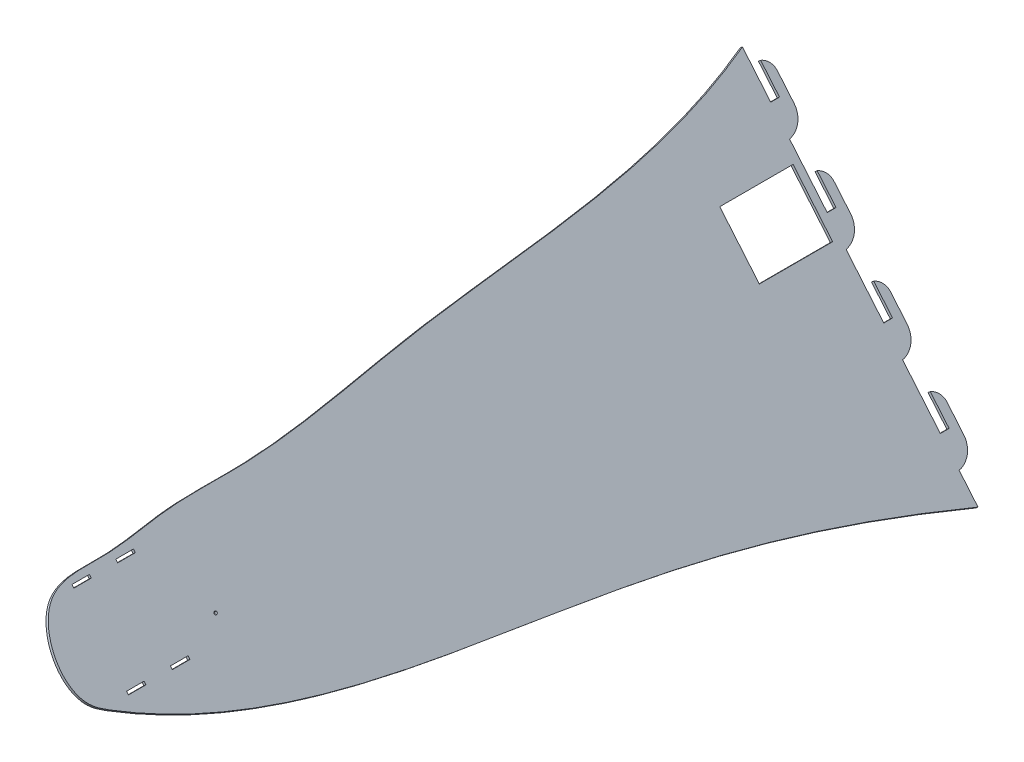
ISO-10303-21;
HEADER;
FILE_DESCRIPTION(('STEP AP214'),'2;1');
FILE_NAME('part.step','',(''),(''),'','','');
FILE_SCHEMA(('AUTOMOTIVE_DESIGN { 1 0 10303 214 1 1 1 1 }'));
ENDSEC;
DATA;
#1=APPLICATION_CONTEXT('core data for automotive mechanical design processes');
#2=APPLICATION_PROTOCOL_DEFINITION('international standard','automotive_design',2000,#1);
#3=PRODUCT_CONTEXT('',#1,'mechanical');
#4=PRODUCT('Part','Part','',(#3));
#5=PRODUCT_RELATED_PRODUCT_CATEGORY('part','',(#4));
#6=PRODUCT_DEFINITION_FORMATION('','',#4);
#7=PRODUCT_DEFINITION_CONTEXT('part definition',#1,'design');
#8=PRODUCT_DEFINITION('design','',#6,#7);
#9=PRODUCT_DEFINITION_SHAPE('','',#8);
#10=(LENGTH_UNIT() NAMED_UNIT(*) SI_UNIT(.MILLI.,.METRE.));
#11=(NAMED_UNIT(*) PLANE_ANGLE_UNIT() SI_UNIT($,.RADIAN.));
#12=(NAMED_UNIT(*) SI_UNIT($,.STERADIAN.) SOLID_ANGLE_UNIT());
#13=UNCERTAINTY_MEASURE_WITH_UNIT(LENGTH_MEASURE(1.E-05),#10,'distance_accuracy_value','');
#14=(GEOMETRIC_REPRESENTATION_CONTEXT(3) GLOBAL_UNCERTAINTY_ASSIGNED_CONTEXT((#13)) GLOBAL_UNIT_ASSIGNED_CONTEXT((#10,
#11,#12)) REPRESENTATION_CONTEXT('',''));
#15=CARTESIAN_POINT('',(0.,0.,0.));
#16=DIRECTION('',(0.,0.,1.));
#17=DIRECTION('',(1.,0.,0.));
#18=AXIS2_PLACEMENT_3D('',#15,#16,#17);
#19=CARTESIAN_POINT('',(-65.0275623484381,108.611307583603,550.));
#20=DIRECTION('',(0.766044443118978,0.642787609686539,0.));
#21=DIRECTION('',(-0.642787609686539,0.766044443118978,0.));
#22=AXIS2_PLACEMENT_3D('',#19,#20,#21);
#23=PLANE('',#22);
#24=DIRECTION('',(0.,0.,-1.));
#25=VECTOR('',#24,1.);
#26=CARTESIAN_POINT('',(-25.4961243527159,61.4995743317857,55.0000000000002));
#27=LINE('',#26,#25);
#28=CARTESIAN_POINT('',(-25.4961243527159,61.4995743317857,55.0000000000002));
#29=VERTEX_POINT('',#28);
#30=CARTESIAN_POINT('',(-25.4961243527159,61.4995743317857,5.0000000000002));
#31=VERTEX_POINT('',#30);
#32=EDGE_CURVE('E339',#29,#31,#27,.T.);
#33=ORIENTED_EDGE('',*,*,#32,.F.);
#34=DIRECTION('',(-0.642787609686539,0.766044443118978,0.));
#35=VECTOR('',#34,1.);
#36=CARTESIAN_POINT('',(-25.4961243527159,61.4995743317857,55.0000000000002));
#37=LINE('',#36,#35);
#38=CARTESIAN_POINT('',(1.50095525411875,29.3257077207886,55.0000000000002));
#39=VERTEX_POINT('',#38);
#40=EDGE_CURVE('E49',#39,#29,#37,.T.);
#41=ORIENTED_EDGE('',*,*,#40,.F.);
#42=DIRECTION('',(0.,0.,1.));
#43=VECTOR('',#42,1.);
#44=CARTESIAN_POINT('',(1.50095525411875,29.3257077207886,55.0000000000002));
#45=LINE('',#44,#43);
#46=CARTESIAN_POINT('',(1.50095525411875,29.3257077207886,5.00000000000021));
#47=VERTEX_POINT('',#46);
#48=EDGE_CURVE('E345',#47,#39,#45,.T.);
#49=ORIENTED_EDGE('',*,*,#48,.F.);
#50=DIRECTION('',(0.642787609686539,-0.766044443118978,0.));
#51=VECTOR('',#50,1.);
#52=CARTESIAN_POINT('',(-25.4961243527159,61.4995743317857,5.0000000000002));
#53=LINE('',#52,#51);
#54=EDGE_CURVE('E330',#31,#47,#53,.T.);
#55=ORIENTED_EDGE('',*,*,#54,.F.);
#56=EDGE_LOOP('',(#33,#41,#49,#55));
#57=FACE_BOUND('',#56,.T.);
#58=CARTESIAN_POINT('',(5.53499218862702,24.5181297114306,430.));
#59=DIRECTION('',(-0.766044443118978,-0.642787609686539,0.));
#60=DIRECTION('',(0.642787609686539,-0.766044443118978,0.));
#61=AXIS2_PLACEMENT_3D('',#58,#59,#60);
#62=CIRCLE('',#61,0.999999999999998);
#63=CARTESIAN_POINT('',(6.17777979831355,23.7520852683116,430.));
#64=VERTEX_POINT('',#63);
#65=EDGE_CURVE('E356',#64,#64,#62,.T.);
#66=ORIENTED_EDGE('',*,*,#65,.F.);
#67=EDGE_LOOP('',(#66));
#68=FACE_BOUND('',#67,.T.);
#69=DIRECTION('',(0.,0.,1.));
#70=VECTOR('',#69,1.);
#71=CARTESIAN_POINT('',(-23.1945874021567,58.7567094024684,550.));
#72=LINE('',#71,#70);
#73=CARTESIAN_POINT('',(-23.1945874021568,58.7567094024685,456.));
#74=VERTEX_POINT('',#73);
#75=CARTESIAN_POINT('',(-23.1945874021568,58.7567094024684,468.));
#76=VERTEX_POINT('',#75);
#77=EDGE_CURVE('E478',#74,#76,#72,.T.);
#78=ORIENTED_EDGE('',*,*,#77,.F.);
#79=DIRECTION('',(-0.642787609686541,0.766044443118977,0.));
#80=VECTOR('',#79,1.);
#81=CARTESIAN_POINT('',(-24.4801626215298,60.2887982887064,456.));
#82=LINE('',#81,#80);
#83=CARTESIAN_POINT('',(-24.4801626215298,60.2887982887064,456.));
#84=VERTEX_POINT('',#83);
#85=EDGE_CURVE('E400',#74,#84,#82,.T.);
#86=ORIENTED_EDGE('',*,*,#85,.T.);
#87=DIRECTION('',(0.,0.,-1.));
#88=VECTOR('',#87,1.);
#89=CARTESIAN_POINT('',(-24.4801626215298,60.2887982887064,550.));
#90=LINE('',#89,#88);
#91=CARTESIAN_POINT('',(-24.4801626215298,60.2887982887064,468.));
#92=VERTEX_POINT('',#91);
#93=EDGE_CURVE('E473',#92,#84,#90,.T.);
#94=ORIENTED_EDGE('',*,*,#93,.F.);
#95=DIRECTION('',(0.642787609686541,-0.766044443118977,0.));
#96=VECTOR('',#95,1.);
#97=CARTESIAN_POINT('',(-24.4801626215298,60.2887982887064,468.));
#98=LINE('',#97,#96);
#99=EDGE_CURVE('E409',#92,#76,#98,.T.);
#100=ORIENTED_EDGE('',*,*,#99,.T.);
#101=EDGE_LOOP('',(#78,#86,#94,#100));
#102=FACE_BOUND('',#101,.T.);
#103=CARTESIAN_POINT('',(-23.1945874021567,58.7567094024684,486.));
#104=VERTEX_POINT('',#103);
#105=CARTESIAN_POINT('',(-23.1945874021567,58.7567094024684,498.));
#106=VERTEX_POINT('',#105);
#107=EDGE_CURVE('E476',#104,#106,#72,.T.);
#108=ORIENTED_EDGE('',*,*,#107,.F.);
#109=DIRECTION('',(-0.642787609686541,0.766044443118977,0.));
#110=VECTOR('',#109,1.);
#111=CARTESIAN_POINT('',(-24.4801626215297,60.2887982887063,486.));
#112=LINE('',#111,#110);
#113=CARTESIAN_POINT('',(-24.4801626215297,60.2887982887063,486.));
#114=VERTEX_POINT('',#113);
#115=EDGE_CURVE('E367',#104,#114,#112,.T.);
#116=ORIENTED_EDGE('',*,*,#115,.T.);
#117=CARTESIAN_POINT('',(-24.4801626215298,60.2887982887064,498.));
#118=VERTEX_POINT('',#117);
#119=EDGE_CURVE('E475',#118,#114,#90,.T.);
#120=ORIENTED_EDGE('',*,*,#119,.F.);
#121=DIRECTION('',(0.642787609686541,-0.766044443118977,0.));
#122=VECTOR('',#121,1.);
#123=CARTESIAN_POINT('',(-24.4801626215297,60.2887982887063,498.));
#124=LINE('',#123,#122);
#125=EDGE_CURVE('E375',#118,#106,#124,.T.);
#126=ORIENTED_EDGE('',*,*,#125,.T.);
#127=EDGE_LOOP('',(#108,#116,#120,#126));
#128=FACE_BOUND('',#127,.T.);
#129=DIRECTION('',(0.,0.,1.));
#130=VECTOR('',#129,1.);
#131=CARTESIAN_POINT('',(14.0870939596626,14.3261317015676,550.));
#132=LINE('',#131,#130);
#133=CARTESIAN_POINT('',(14.0870939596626,14.3261317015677,456.));
#134=VERTEX_POINT('',#133);
#135=CARTESIAN_POINT('',(14.0870939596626,14.3261317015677,468.));
#136=VERTEX_POINT('',#135);
#137=EDGE_CURVE('E472',#134,#136,#132,.T.);
#138=ORIENTED_EDGE('',*,*,#137,.F.);
#139=DIRECTION('',(-0.642787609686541,0.766044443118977,0.));
#140=VECTOR('',#139,1.);
#141=CARTESIAN_POINT('',(12.8015187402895,15.8582205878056,456.));
#142=LINE('',#141,#140);
#143=CARTESIAN_POINT('',(12.8015187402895,15.8582205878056,456.));
#144=VERTEX_POINT('',#143);
#145=EDGE_CURVE('E452',#134,#144,#142,.T.);
#146=ORIENTED_EDGE('',*,*,#145,.T.);
#147=DIRECTION('',(0.,0.,-1.));
#148=VECTOR('',#147,1.);
#149=CARTESIAN_POINT('',(12.8015187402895,15.8582205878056,550.));
#150=LINE('',#149,#148);
#151=CARTESIAN_POINT('',(12.8015187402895,15.8582205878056,468.));
#152=VERTEX_POINT('',#151);
#153=EDGE_CURVE('E417',#152,#144,#150,.T.);
#154=ORIENTED_EDGE('',*,*,#153,.F.);
#155=DIRECTION('',(0.642787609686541,-0.766044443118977,0.));
#156=VECTOR('',#155,1.);
#157=CARTESIAN_POINT('',(12.8015187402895,15.8582205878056,468.));
#158=LINE('',#157,#156);
#159=EDGE_CURVE('E461',#152,#136,#158,.T.);
#160=ORIENTED_EDGE('',*,*,#159,.T.);
#161=EDGE_LOOP('',(#138,#146,#154,#160));
#162=FACE_BOUND('',#161,.T.);
#163=CARTESIAN_POINT('',(14.0870939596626,14.3261317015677,486.));
#164=VERTEX_POINT('',#163);
#165=CARTESIAN_POINT('',(14.0870939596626,14.3261317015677,498.));
#166=VERTEX_POINT('',#165);
#167=EDGE_CURVE('E470',#164,#166,#132,.T.);
#168=ORIENTED_EDGE('',*,*,#167,.F.);
#169=DIRECTION('',(-0.642787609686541,0.766044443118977,0.));
#170=VECTOR('',#169,1.);
#171=CARTESIAN_POINT('',(12.8015187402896,15.8582205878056,486.));
#172=LINE('',#171,#170);
#173=CARTESIAN_POINT('',(12.8015187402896,15.8582205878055,486.));
#174=VERTEX_POINT('',#173);
#175=EDGE_CURVE('E421',#164,#174,#172,.T.);
#176=ORIENTED_EDGE('',*,*,#175,.T.);
#177=CARTESIAN_POINT('',(12.8015187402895,15.8582205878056,498.));
#178=VERTEX_POINT('',#177);
#179=EDGE_CURVE('E469',#178,#174,#150,.T.);
#180=ORIENTED_EDGE('',*,*,#179,.F.);
#181=DIRECTION('',(0.642787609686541,-0.766044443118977,0.));
#182=VECTOR('',#181,1.);
#183=CARTESIAN_POINT('',(12.8015187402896,15.8582205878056,498.));
#184=LINE('',#183,#182);
#185=EDGE_CURVE('E363',#178,#166,#184,.T.);
#186=ORIENTED_EDGE('',*,*,#185,.T.);
#187=EDGE_LOOP('',(#168,#176,#180,#186));
#188=FACE_BOUND('',#187,.T.);
#189=DIRECTION('',(0.642787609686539,-0.766044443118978,0.));
#190=VECTOR('',#189,1.);
#191=CARTESIAN_POINT('',(-65.0275623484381,108.611307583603,0.));
#192=LINE('',#191,#190);
#193=CARTESIAN_POINT('',(-65.0275623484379,108.611307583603,0.));
#194=VERTEX_POINT('',#193);
#195=CARTESIAN_POINT('',(-45.7439340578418,85.6299742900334,0.));
#196=VERTEX_POINT('',#195);
#197=EDGE_CURVE('E624',#194,#196,#192,.T.);
#198=ORIENTED_EDGE('',*,*,#197,.T.);
#199=DIRECTION('',(0.,0.,-1.));
#200=VECTOR('',#199,1.);
#201=CARTESIAN_POINT('',(-45.7439340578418,85.6299742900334,-6.));
#202=LINE('',#201,#200);
#203=CARTESIAN_POINT('',(-45.7439340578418,85.6299742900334,-6.));
#204=VERTEX_POINT('',#203);
#205=EDGE_CURVE('E613',#196,#204,#202,.T.);
#206=ORIENTED_EDGE('',*,*,#205,.T.);
#207=DIRECTION('',(-0.642787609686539,0.766044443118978,0.));
#208=VECTOR('',#207,1.);
#209=CARTESIAN_POINT('',(-45.7439340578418,85.6299742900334,-6.));
#210=LINE('',#209,#208);
#211=CARTESIAN_POINT('',(-58.5996862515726,100.950863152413,-6.00000000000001));
#212=VERTEX_POINT('',#211);
#213=EDGE_CURVE('E674',#204,#212,#210,.T.);
#214=ORIENTED_EDGE('',*,*,#213,.T.);
#215=CARTESIAN_POINT('',(-53.1454525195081,94.4507605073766,-3.));
#216=DIRECTION('',(0.766044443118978,0.642787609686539,0.));
#217=DIRECTION('',(-0.642787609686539,0.766044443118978,0.));
#218=AXIS2_PLACEMENT_3D('',#215,#216,#217);
#219=CIRCLE('',#218,9.);
#220=CARTESIAN_POINT('',(-53.1454525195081,94.4507605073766,-12.));
#221=VERTEX_POINT('',#220);
#222=EDGE_CURVE('E661',#212,#221,#219,.F.);
#223=ORIENTED_EDGE('',*,*,#222,.T.);
#224=DIRECTION('',(0.642787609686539,-0.766044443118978,0.));
#225=VECTOR('',#224,1.);
#226=CARTESIAN_POINT('',(-41.7949082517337,80.9237085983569,-12.));
#227=LINE('',#226,#225);
#228=CARTESIAN_POINT('',(-41.7949082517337,80.9237085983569,-12.));
#229=VERTEX_POINT('',#228);
#230=EDGE_CURVE('E660',#221,#229,#227,.T.);
#231=ORIENTED_EDGE('',*,*,#230,.T.);
#232=CARTESIAN_POINT('',(-41.7949082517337,80.9237085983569,2.));
#233=DIRECTION('',(0.766044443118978,0.642787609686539,0.));
#234=DIRECTION('',(-0.642787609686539,0.766044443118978,0.));
#235=AXIS2_PLACEMENT_3D('',#232,#233,#234);
#236=CIRCLE('',#235,14.);
#237=CARTESIAN_POINT('',(-32.888181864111,70.3090854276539,0.));
#238=VERTEX_POINT('',#237);
#239=EDGE_CURVE('E629',#229,#238,#236,.F.);
#240=ORIENTED_EDGE('',*,*,#239,.T.);
#241=CARTESIAN_POINT('',(-7.17667747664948,39.6673077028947,0.));
#242=VERTEX_POINT('',#241);
#243=EDGE_CURVE('E652',#238,#242,#192,.T.);
#244=ORIENTED_EDGE('',*,*,#243,.T.);
#245=DIRECTION('',(0.,0.,-1.));
#246=VECTOR('',#245,1.);
#247=CARTESIAN_POINT('',(-7.17667747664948,39.6673077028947,-6.));
#248=LINE('',#247,#246);
#249=CARTESIAN_POINT('',(-7.17667747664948,39.6673077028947,-6.));
#250=VERTEX_POINT('',#249);
#251=EDGE_CURVE('E691',#242,#250,#248,.T.);
#252=ORIENTED_EDGE('',*,*,#251,.T.);
#253=DIRECTION('',(-0.642787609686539,0.766044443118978,0.));
#254=VECTOR('',#253,1.);
#255=CARTESIAN_POINT('',(-7.17667747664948,39.6673077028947,-6.));
#256=LINE('',#255,#254);
#257=CARTESIAN_POINT('',(-20.0324296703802,54.9881965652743,-6.00000000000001));
#258=VERTEX_POINT('',#257);
#259=EDGE_CURVE('E698',#250,#258,#256,.T.);
#260=ORIENTED_EDGE('',*,*,#259,.T.);
#261=CARTESIAN_POINT('',(-14.5781959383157,48.4880939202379,-3.));
#262=DIRECTION('',(0.766044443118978,0.642787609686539,0.));
#263=DIRECTION('',(-0.642787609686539,0.766044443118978,0.));
#264=AXIS2_PLACEMENT_3D('',#261,#262,#263);
#265=CIRCLE('',#264,9.);
#266=CARTESIAN_POINT('',(-14.5781959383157,48.4880939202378,-12.));
#267=VERTEX_POINT('',#266);
#268=EDGE_CURVE('E706',#258,#267,#265,.F.);
#269=ORIENTED_EDGE('',*,*,#268,.T.);
#270=DIRECTION('',(0.642787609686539,-0.766044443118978,0.));
#271=VECTOR('',#270,1.);
#272=CARTESIAN_POINT('',(-3.22765167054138,34.9610420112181,-12.));
#273=LINE('',#272,#271);
#274=CARTESIAN_POINT('',(-3.22765167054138,34.9610420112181,-12.));
#275=VERTEX_POINT('',#274);
#276=EDGE_CURVE('E717',#267,#275,#273,.T.);
#277=ORIENTED_EDGE('',*,*,#276,.T.);
#278=CARTESIAN_POINT('',(-3.22765167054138,34.9610420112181,2.));
#279=DIRECTION('',(0.766044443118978,0.642787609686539,0.));
#280=DIRECTION('',(-0.642787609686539,0.766044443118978,0.));
#281=AXIS2_PLACEMENT_3D('',#278,#279,#280);
#282=CIRCLE('',#281,14.);
#283=CARTESIAN_POINT('',(5.6790747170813,24.3464188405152,0.));
#284=VERTEX_POINT('',#283);
#285=EDGE_CURVE('E685',#275,#284,#282,.F.);
#286=ORIENTED_EDGE('',*,*,#285,.T.);
#287=CARTESIAN_POINT('',(31.3905791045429,-6.29535888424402,0.));
#288=VERTEX_POINT('',#287);
#289=EDGE_CURVE('E658',#284,#288,#192,.T.);
#290=ORIENTED_EDGE('',*,*,#289,.T.);
#291=DIRECTION('',(0.,0.,-1.));
#292=VECTOR('',#291,1.);
#293=CARTESIAN_POINT('',(31.3905791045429,-6.29535888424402,-6.));
#294=LINE('',#293,#292);
#295=CARTESIAN_POINT('',(31.3905791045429,-6.29535888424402,-6.));
#296=VERTEX_POINT('',#295);
#297=EDGE_CURVE('E734',#288,#296,#294,.T.);
#298=ORIENTED_EDGE('',*,*,#297,.T.);
#299=DIRECTION('',(-0.642787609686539,0.766044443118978,0.));
#300=VECTOR('',#299,1.);
#301=CARTESIAN_POINT('',(31.3905791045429,-6.29535888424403,-6.));
#302=LINE('',#301,#300);
#303=CARTESIAN_POINT('',(18.5348269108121,9.02552997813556,-6.00000000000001));
#304=VERTEX_POINT('',#303);
#305=EDGE_CURVE('E742',#296,#304,#302,.T.);
#306=ORIENTED_EDGE('',*,*,#305,.T.);
#307=CARTESIAN_POINT('',(23.9890606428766,2.52542733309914,-3.));
#308=DIRECTION('',(0.766044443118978,0.642787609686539,0.));
#309=DIRECTION('',(-0.642787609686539,0.766044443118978,0.));
#310=AXIS2_PLACEMENT_3D('',#307,#308,#309);
#311=CIRCLE('',#310,9.);
#312=CARTESIAN_POINT('',(23.9890606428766,2.52542733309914,-12.));
#313=VERTEX_POINT('',#312);
#314=EDGE_CURVE('E750',#304,#313,#311,.F.);
#315=ORIENTED_EDGE('',*,*,#314,.T.);
#316=DIRECTION('',(0.642787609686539,-0.766044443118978,0.));
#317=VECTOR('',#316,1.);
#318=CARTESIAN_POINT('',(35.3396049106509,-11.0016245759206,-12.));
#319=LINE('',#318,#317);
#320=CARTESIAN_POINT('',(35.3396049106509,-11.0016245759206,-12.));
#321=VERTEX_POINT('',#320);
#322=EDGE_CURVE('E761',#313,#321,#319,.T.);
#323=ORIENTED_EDGE('',*,*,#322,.T.);
#324=CARTESIAN_POINT('',(35.3396049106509,-11.0016245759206,2.));
#325=DIRECTION('',(0.766044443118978,0.642787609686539,0.));
#326=DIRECTION('',(-0.642787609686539,0.766044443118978,0.));
#327=AXIS2_PLACEMENT_3D('',#324,#325,#326);
#328=CIRCLE('',#327,14.);
#329=CARTESIAN_POINT('',(44.2463312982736,-21.6162477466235,0.));
#330=VERTEX_POINT('',#329);
#331=EDGE_CURVE('E725',#321,#330,#328,.F.);
#332=ORIENTED_EDGE('',*,*,#331,.T.);
#333=CARTESIAN_POINT('',(69.9578356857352,-52.2580254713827,0.));
#334=VERTEX_POINT('',#333);
#335=EDGE_CURVE('E767',#330,#334,#192,.T.);
#336=ORIENTED_EDGE('',*,*,#335,.T.);
#337=DIRECTION('',(0.,0.,-1.));
#338=VECTOR('',#337,1.);
#339=CARTESIAN_POINT('',(69.9578356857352,-52.2580254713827,-6.));
#340=LINE('',#339,#338);
#341=CARTESIAN_POINT('',(69.9578356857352,-52.2580254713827,-6.));
#342=VERTEX_POINT('',#341);
#343=EDGE_CURVE('E484',#334,#342,#340,.T.);
#344=ORIENTED_EDGE('',*,*,#343,.T.);
#345=DIRECTION('',(-0.642787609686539,0.766044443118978,0.));
#346=VECTOR('',#345,1.);
#347=CARTESIAN_POINT('',(69.9578356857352,-52.2580254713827,-6.));
#348=LINE('',#347,#346);
#349=CARTESIAN_POINT('',(57.1020834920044,-36.9371366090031,-6.00000000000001));
#350=VERTEX_POINT('',#349);
#351=EDGE_CURVE('E481',#342,#350,#348,.T.);
#352=ORIENTED_EDGE('',*,*,#351,.T.);
#353=CARTESIAN_POINT('',(62.5563172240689,-43.4372392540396,-3.));
#354=DIRECTION('',(0.766044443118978,0.642787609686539,0.));
#355=DIRECTION('',(-0.642787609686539,0.766044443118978,0.));
#356=AXIS2_PLACEMENT_3D('',#353,#354,#355);
#357=CIRCLE('',#356,9.);
#358=CARTESIAN_POINT('',(62.5563172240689,-43.4372392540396,-12.));
#359=VERTEX_POINT('',#358);
#360=EDGE_CURVE('E479',#350,#359,#357,.F.);
#361=ORIENTED_EDGE('',*,*,#360,.T.);
#362=DIRECTION('',(0.642787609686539,-0.766044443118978,0.));
#363=VECTOR('',#362,1.);
#364=CARTESIAN_POINT('',(73.9068614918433,-56.9642911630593,-12.));
#365=LINE('',#364,#363);
#366=CARTESIAN_POINT('',(73.9068614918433,-56.9642911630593,-12.));
#367=VERTEX_POINT('',#366);
#368=EDGE_CURVE('E489',#359,#367,#365,.T.);
#369=ORIENTED_EDGE('',*,*,#368,.T.);
#370=CARTESIAN_POINT('',(73.9068614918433,-56.9642911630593,2.));
#371=DIRECTION('',(0.766044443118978,0.642787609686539,0.));
#372=DIRECTION('',(-0.642787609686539,0.766044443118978,0.));
#373=AXIS2_PLACEMENT_3D('',#370,#371,#372);
#374=CIRCLE('',#373,14.);
#375=CARTESIAN_POINT('',(82.813587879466,-67.5789143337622,0.));
#376=VERTEX_POINT('',#375);
#377=EDGE_CURVE('E486',#367,#376,#374,.F.);
#378=ORIENTED_EDGE('',*,*,#377,.T.);
#379=CARTESIAN_POINT('',(95.6693400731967,-82.8998031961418,0.));
#380=VERTEX_POINT('',#379);
#381=EDGE_CURVE('E772',#376,#380,#192,.T.);
#382=ORIENTED_EDGE('',*,*,#381,.T.);
#383=CARTESIAN_POINT('',(95.6693400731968,-82.8998031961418,0.));
#384=CARTESIAN_POINT('',(67.1310265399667,-48.8891655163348,122.602086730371));
#385=CARTESIAN_POINT('',(59.2166332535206,-39.4571588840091,261.48657203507));
#386=CARTESIAN_POINT('',(41.0296573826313,-17.7827650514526,449.056291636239));
#387=CARTESIAN_POINT('',(6.61510846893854,23.2308972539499,533.024278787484));
#388=CARTESIAN_POINT('',(-29.8144442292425,66.6459475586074,524.378628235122));
#389=CARTESIAN_POINT('',(-25.8601256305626,61.9333741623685,470.683687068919));
#390=CARTESIAN_POINT('',(-31.0610218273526,68.1315608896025,426.394617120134));
#391=CARTESIAN_POINT('',(-28.8442085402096,65.4896656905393,351.686074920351));
#392=CARTESIAN_POINT('',(-45.4113967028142,85.2336717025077,209.735645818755));
#393=CARTESIAN_POINT('',(-44.5886341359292,84.2531414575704,81.8630782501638));
#394=CARTESIAN_POINT('',(-65.027562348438,108.611307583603,0.));
#395=B_SPLINE_CURVE_WITH_KNOTS('',3,(#383,#384,#385,#386,#387,#388,#389,#390,#391,#392,#393,
#394),.UNSPECIFIED.,.F.,.F.,(4,1,1,1,1,1,1,1,1,4),(0.,0.267493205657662,0.474444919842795,
0.484207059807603,0.531876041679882,0.569158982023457,0.610649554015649,0.657524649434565,
0.768364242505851,1.),.UNSPECIFIED.);
#396=EDGE_CURVE('E775',#194,#380,#395,.F.);
#397=ORIENTED_EDGE('',*,*,#396,.F.);
#398=EDGE_LOOP('',(#198,#206,#214,#223,#231,#240,#244,#252,#260,#269,#277,#286,#290,#298,#306,
#315,#323,#332,#336,#344,#352,#361,#369,#378,#382,#397));
#399=FACE_BOUND('',#398,.T.);
#400=ADVANCED_FACE('F34',(#57,#68,#102,#128,#162,#188,#399),#23,.F.);
#401=CARTESIAN_POINT('',(-63.4954734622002,109.896882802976,550.));
#402=DIRECTION('',(-0.766044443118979,-0.642787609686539,0.));
#403=DIRECTION('',(0.642787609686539,-0.766044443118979,0.));
#404=AXIS2_PLACEMENT_3D('',#401,#402,#403);
#405=PLANE('',#404);
#406=DIRECTION('',(0.,0.,-1.));
#407=VECTOR('',#406,1.);
#408=CARTESIAN_POINT('',(3.0330441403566,30.6112829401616,55.0000000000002));
#409=LINE('',#408,#407);
#410=CARTESIAN_POINT('',(3.0330441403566,30.6112829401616,55.0000000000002));
#411=VERTEX_POINT('',#410);
#412=CARTESIAN_POINT('',(3.0330441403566,30.6112829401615,5.00000000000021));
#413=VERTEX_POINT('',#412);
#414=EDGE_CURVE('E1235',#411,#413,#409,.T.);
#415=ORIENTED_EDGE('',*,*,#414,.F.);
#416=DIRECTION('',(0.642787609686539,-0.766044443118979,0.));
#417=VECTOR('',#416,1.);
#418=CARTESIAN_POINT('',(-23.964035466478,62.7851495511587,55.0000000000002));
#419=LINE('',#418,#417);
#420=CARTESIAN_POINT('',(-23.964035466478,62.7851495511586,55.0000000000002));
#421=VERTEX_POINT('',#420);
#422=EDGE_CURVE('E357',#421,#411,#419,.T.);
#423=ORIENTED_EDGE('',*,*,#422,.F.);
#424=DIRECTION('',(0.,0.,1.));
#425=VECTOR('',#424,1.);
#426=CARTESIAN_POINT('',(-23.964035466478,62.7851495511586,55.0000000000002));
#427=LINE('',#426,#425);
#428=CARTESIAN_POINT('',(-23.964035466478,62.7851495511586,5.00000000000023));
#429=VERTEX_POINT('',#428);
#430=EDGE_CURVE('E354',#429,#421,#427,.T.);
#431=ORIENTED_EDGE('',*,*,#430,.F.);
#432=DIRECTION('',(-0.642787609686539,0.766044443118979,0.));
#433=VECTOR('',#432,1.);
#434=CARTESIAN_POINT('',(-23.964035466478,62.7851495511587,5.0000000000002));
#435=LINE('',#434,#433);
#436=EDGE_CURVE('E333',#413,#429,#435,.T.);
#437=ORIENTED_EDGE('',*,*,#436,.F.);
#438=EDGE_LOOP('',(#415,#423,#431,#437));
#439=FACE_BOUND('',#438,.T.);
#440=CARTESIAN_POINT('',(7.06708107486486,25.8037049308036,430.));
#441=DIRECTION('',(-0.766044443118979,-0.642787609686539,0.));
#442=DIRECTION('',(0.642787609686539,-0.766044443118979,0.));
#443=AXIS2_PLACEMENT_3D('',#440,#441,#442);
#444=CIRCLE('',#443,0.999999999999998);
#445=CARTESIAN_POINT('',(7.70986868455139,25.0376604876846,430.));
#446=VERTEX_POINT('',#445);
#447=EDGE_CURVE('E360',#446,#446,#444,.F.);
#448=ORIENTED_EDGE('',*,*,#447,.F.);
#449=EDGE_LOOP('',(#448));
#450=FACE_BOUND('',#449,.T.);
#451=DIRECTION('',(0.642787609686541,-0.766044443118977,0.));
#452=VECTOR('',#451,1.);
#453=CARTESIAN_POINT('',(-22.9480737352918,61.5743735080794,498.));
#454=LINE('',#453,#452);
#455=CARTESIAN_POINT('',(-22.9480737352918,61.5743735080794,498.));
#456=VERTEX_POINT('',#455);
#457=CARTESIAN_POINT('',(-21.6624985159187,60.0422846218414,498.));
#458=VERTEX_POINT('',#457);
#459=EDGE_CURVE('E364',#456,#458,#454,.T.);
#460=ORIENTED_EDGE('',*,*,#459,.F.);
#461=DIRECTION('',(0.,0.,1.));
#462=VECTOR('',#461,1.);
#463=CARTESIAN_POINT('',(-22.9480737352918,61.5743735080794,498.));
#464=LINE('',#463,#462);
#465=CARTESIAN_POINT('',(-22.9480737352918,61.5743735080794,486.));
#466=VERTEX_POINT('',#465);
#467=EDGE_CURVE('E372',#466,#456,#464,.T.);
#468=ORIENTED_EDGE('',*,*,#467,.F.);
#469=DIRECTION('',(-0.642787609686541,0.766044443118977,0.));
#470=VECTOR('',#469,1.);
#471=CARTESIAN_POINT('',(-22.9480737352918,61.5743735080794,486.));
#472=LINE('',#471,#470);
#473=CARTESIAN_POINT('',(-21.6624985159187,60.0422846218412,486.));
#474=VERTEX_POINT('',#473);
#475=EDGE_CURVE('E370',#474,#466,#472,.T.);
#476=ORIENTED_EDGE('',*,*,#475,.F.);
#477=DIRECTION('',(0.,0.,-1.));
#478=VECTOR('',#477,1.);
#479=CARTESIAN_POINT('',(-21.6624985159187,60.0422846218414,498.));
#480=LINE('',#479,#478);
#481=EDGE_CURVE('E366',#458,#474,#480,.T.);
#482=ORIENTED_EDGE('',*,*,#481,.F.);
#483=EDGE_LOOP('',(#460,#468,#476,#482));
#484=FACE_BOUND('',#483,.T.);
#485=DIRECTION('',(0.642787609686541,-0.766044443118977,0.));
#486=VECTOR('',#485,1.);
#487=CARTESIAN_POINT('',(14.3336076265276,17.1437958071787,498.));
#488=LINE('',#487,#486);
#489=CARTESIAN_POINT('',(14.3336076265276,17.1437958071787,498.));
#490=VERTEX_POINT('',#489);
#491=CARTESIAN_POINT('',(15.6191828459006,15.6117069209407,498.));
#492=VERTEX_POINT('',#491);
#493=EDGE_CURVE('E418',#490,#492,#488,.T.);
#494=ORIENTED_EDGE('',*,*,#493,.F.);
#495=DIRECTION('',(0.,0.,1.));
#496=VECTOR('',#495,1.);
#497=CARTESIAN_POINT('',(14.3336076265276,17.1437958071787,498.));
#498=LINE('',#497,#496);
#499=CARTESIAN_POINT('',(14.3336076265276,17.1437958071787,486.));
#500=VERTEX_POINT('',#499);
#501=EDGE_CURVE('E426',#500,#490,#498,.T.);
#502=ORIENTED_EDGE('',*,*,#501,.F.);
#503=DIRECTION('',(-0.642787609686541,0.766044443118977,0.));
#504=VECTOR('',#503,1.);
#505=CARTESIAN_POINT('',(14.3336076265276,17.1437958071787,486.));
#506=LINE('',#505,#504);
#507=CARTESIAN_POINT('',(15.6191828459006,15.6117069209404,486.));
#508=VERTEX_POINT('',#507);
#509=EDGE_CURVE('E424',#508,#500,#506,.T.);
#510=ORIENTED_EDGE('',*,*,#509,.F.);
#511=DIRECTION('',(0.,0.,-1.));
#512=VECTOR('',#511,1.);
#513=CARTESIAN_POINT('',(15.6191828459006,15.6117069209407,498.));
#514=LINE('',#513,#512);
#515=EDGE_CURVE('E420',#492,#508,#514,.T.);
#516=ORIENTED_EDGE('',*,*,#515,.F.);
#517=EDGE_LOOP('',(#494,#502,#510,#516));
#518=FACE_BOUND('',#517,.T.);
#519=DIRECTION('',(-0.642787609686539,0.766044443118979,0.));
#520=VECTOR('',#519,1.);
#521=CARTESIAN_POINT('',(-63.4954734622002,109.896882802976,0.));
#522=LINE('',#521,#520);
#523=CARTESIAN_POINT('',(-5.64458859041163,40.9528829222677,0.));
#524=VERTEX_POINT('',#523);
#525=CARTESIAN_POINT('',(-31.3560929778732,71.5946606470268,0.));
#526=VERTEX_POINT('',#525);
#527=EDGE_CURVE('E643',#524,#526,#522,.T.);
#528=ORIENTED_EDGE('',*,*,#527,.T.);
#529=CARTESIAN_POINT('',(-40.2628193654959,82.2092838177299,2.));
#530=DIRECTION('',(0.766044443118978,0.642787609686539,0.));
#531=DIRECTION('',(0.642787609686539,-0.766044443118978,0.));
#532=AXIS2_PLACEMENT_3D('',#529,#530,#531);
#533=CIRCLE('',#532,14.);
#534=CARTESIAN_POINT('',(-40.2628193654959,82.2092838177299,-12.));
#535=VERTEX_POINT('',#534);
#536=EDGE_CURVE('E42',#526,#535,#533,.T.);
#537=ORIENTED_EDGE('',*,*,#536,.T.);
#538=DIRECTION('',(-0.642787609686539,0.766044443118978,0.));
#539=VECTOR('',#538,1.);
#540=CARTESIAN_POINT('',(-40.2628193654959,82.2092838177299,-12.));
#541=LINE('',#540,#539);
#542=CARTESIAN_POINT('',(-51.6133636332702,95.7363357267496,-12.));
#543=VERTEX_POINT('',#542);
#544=EDGE_CURVE('E640',#535,#543,#541,.T.);
#545=ORIENTED_EDGE('',*,*,#544,.T.);
#546=CARTESIAN_POINT('',(-51.6133636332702,95.7363357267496,-3.));
#547=DIRECTION('',(0.766044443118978,0.642787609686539,0.));
#548=DIRECTION('',(-0.642787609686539,0.766044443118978,0.));
#549=AXIS2_PLACEMENT_3D('',#546,#547,#548);
#550=CIRCLE('',#549,9.);
#551=CARTESIAN_POINT('',(-57.0675973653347,102.236438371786,-6.00000000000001));
#552=VERTEX_POINT('',#551);
#553=EDGE_CURVE('E672',#543,#552,#550,.T.);
#554=ORIENTED_EDGE('',*,*,#553,.T.);
#555=DIRECTION('',(0.642787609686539,-0.766044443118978,0.));
#556=VECTOR('',#555,1.);
#557=CARTESIAN_POINT('',(-44.211845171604,86.9155495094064,-6.));
#558=LINE('',#557,#556);
#559=CARTESIAN_POINT('',(-44.211845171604,86.9155495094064,-6.));
#560=VERTEX_POINT('',#559);
#561=EDGE_CURVE('E621',#552,#560,#558,.T.);
#562=ORIENTED_EDGE('',*,*,#561,.T.);
#563=DIRECTION('',(0.,0.,1.));
#564=VECTOR('',#563,1.);
#565=CARTESIAN_POINT('',(-44.211845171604,86.9155495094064,-6.));
#566=LINE('',#565,#564);
#567=CARTESIAN_POINT('',(-44.211845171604,86.9155495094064,0.));
#568=VERTEX_POINT('',#567);
#569=EDGE_CURVE('E627',#560,#568,#566,.T.);
#570=ORIENTED_EDGE('',*,*,#569,.T.);
#571=CARTESIAN_POINT('',(-63.4954734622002,109.896882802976,0.));
#572=VERTEX_POINT('',#571);
#573=EDGE_CURVE('E626',#568,#572,#522,.T.);
#574=ORIENTED_EDGE('',*,*,#573,.T.);
#575=CARTESIAN_POINT('',(97.2014289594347,-81.6142279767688,0.));
#576=CARTESIAN_POINT('',(68.6631154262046,-47.6035902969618,122.602086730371));
#577=CARTESIAN_POINT('',(60.7487221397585,-38.1715836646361,261.48657203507));
#578=CARTESIAN_POINT('',(42.5617462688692,-16.4971898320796,449.056291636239));
#579=CARTESIAN_POINT('',(8.14719735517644,24.5164724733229,533.024278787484));
#580=CARTESIAN_POINT('',(-28.2823553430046,67.9315227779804,524.378628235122));
#581=CARTESIAN_POINT('',(-24.3280367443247,63.2189493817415,470.683687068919));
#582=CARTESIAN_POINT('',(-29.5289329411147,69.4171361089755,426.394617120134));
#583=CARTESIAN_POINT('',(-27.3121196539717,66.7752409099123,351.686074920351));
#584=CARTESIAN_POINT('',(-43.8793078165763,86.5192469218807,209.735645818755));
#585=CARTESIAN_POINT('',(-43.0565452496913,85.5387166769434,81.8630782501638));
#586=CARTESIAN_POINT('',(-63.4954734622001,109.896882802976,0.));
#587=B_SPLINE_CURVE_WITH_KNOTS('',3,(#575,#576,#577,#578,#579,#580,#581,#582,#583,#584,#585,
#586),.UNSPECIFIED.,.F.,.F.,(4,1,1,1,1,1,1,1,1,4),(0.,0.267493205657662,0.474444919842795,
0.484207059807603,0.531876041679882,0.569158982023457,0.610649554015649,0.657524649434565,
0.768364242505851,1.),.UNSPECIFIED.);
#588=CARTESIAN_POINT('',(97.2014289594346,-81.6142279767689,0.));
#589=VERTEX_POINT('',#588);
#590=EDGE_CURVE('E518',#589,#572,#587,.T.);
#591=ORIENTED_EDGE('',*,*,#590,.F.);
#592=CARTESIAN_POINT('',(84.3456767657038,-66.2933391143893,0.));
#593=VERTEX_POINT('',#592);
#594=EDGE_CURVE('E764',#589,#593,#522,.T.);
#595=ORIENTED_EDGE('',*,*,#594,.T.);
#596=CARTESIAN_POINT('',(75.4389503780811,-55.6787159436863,2.));
#597=DIRECTION('',(0.766044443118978,0.642787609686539,0.));
#598=DIRECTION('',(0.642787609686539,-0.766044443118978,0.));
#599=AXIS2_PLACEMENT_3D('',#596,#597,#598);
#600=CIRCLE('',#599,14.);
#601=CARTESIAN_POINT('',(75.4389503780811,-55.6787159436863,-12.));
#602=VERTEX_POINT('',#601);
#603=EDGE_CURVE('E490',#593,#602,#600,.T.);
#604=ORIENTED_EDGE('',*,*,#603,.T.);
#605=DIRECTION('',(-0.642787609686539,0.766044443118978,0.));
#606=VECTOR('',#605,1.);
#607=CARTESIAN_POINT('',(75.4389503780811,-55.6787159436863,-12.));
#608=LINE('',#607,#606);
#609=CARTESIAN_POINT('',(64.0884061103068,-42.1516640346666,-12.));
#610=VERTEX_POINT('',#609);
#611=EDGE_CURVE('E493',#602,#610,#608,.T.);
#612=ORIENTED_EDGE('',*,*,#611,.T.);
#613=CARTESIAN_POINT('',(64.0884061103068,-42.1516640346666,-3.));
#614=DIRECTION('',(0.766044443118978,0.642787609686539,0.));
#615=DIRECTION('',(-0.642787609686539,0.766044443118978,0.));
#616=AXIS2_PLACEMENT_3D('',#613,#614,#615);
#617=CIRCLE('',#616,9.);
#618=CARTESIAN_POINT('',(58.6341723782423,-35.6515613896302,-6.00000000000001));
#619=VERTEX_POINT('',#618);
#620=EDGE_CURVE('E496',#610,#619,#617,.T.);
#621=ORIENTED_EDGE('',*,*,#620,.T.);
#622=DIRECTION('',(0.642787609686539,-0.766044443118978,0.));
#623=VECTOR('',#622,1.);
#624=CARTESIAN_POINT('',(71.489924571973,-50.9724502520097,-6.));
#625=LINE('',#624,#623);
#626=CARTESIAN_POINT('',(71.489924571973,-50.9724502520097,-6.));
#627=VERTEX_POINT('',#626);
#628=EDGE_CURVE('E499',#619,#627,#625,.T.);
#629=ORIENTED_EDGE('',*,*,#628,.T.);
#630=DIRECTION('',(0.,0.,1.));
#631=VECTOR('',#630,1.);
#632=CARTESIAN_POINT('',(71.489924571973,-50.9724502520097,-6.));
#633=LINE('',#632,#631);
#634=CARTESIAN_POINT('',(71.489924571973,-50.9724502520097,0.));
#635=VERTEX_POINT('',#634);
#636=EDGE_CURVE('E502',#627,#635,#633,.T.);
#637=ORIENTED_EDGE('',*,*,#636,.T.);
#638=CARTESIAN_POINT('',(45.7784201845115,-20.3306725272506,0.));
#639=VERTEX_POINT('',#638);
#640=EDGE_CURVE('E768',#635,#639,#522,.T.);
#641=ORIENTED_EDGE('',*,*,#640,.T.);
#642=CARTESIAN_POINT('',(36.8716937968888,-9.71604935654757,2.));
#643=DIRECTION('',(0.766044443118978,0.642787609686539,0.));
#644=DIRECTION('',(0.642787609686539,-0.766044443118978,0.));
#645=AXIS2_PLACEMENT_3D('',#642,#643,#644);
#646=CIRCLE('',#645,14.);
#647=CARTESIAN_POINT('',(36.8716937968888,-9.71604935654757,-12.));
#648=VERTEX_POINT('',#647);
#649=EDGE_CURVE('E722',#639,#648,#646,.T.);
#650=ORIENTED_EDGE('',*,*,#649,.T.);
#651=DIRECTION('',(-0.642787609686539,0.766044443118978,0.));
#652=VECTOR('',#651,1.);
#653=CARTESIAN_POINT('',(36.8716937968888,-9.71604935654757,-12.));
#654=LINE('',#653,#652);
#655=CARTESIAN_POINT('',(25.5211495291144,3.81100255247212,-12.));
#656=VERTEX_POINT('',#655);
#657=EDGE_CURVE('E756',#648,#656,#654,.T.);
#658=ORIENTED_EDGE('',*,*,#657,.T.);
#659=CARTESIAN_POINT('',(25.5211495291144,3.81100255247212,-3.));
#660=DIRECTION('',(0.766044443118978,0.642787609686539,0.));
#661=DIRECTION('',(-0.642787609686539,0.766044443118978,0.));
#662=AXIS2_PLACEMENT_3D('',#659,#660,#661);
#663=CIRCLE('',#662,9.);
#664=CARTESIAN_POINT('',(20.0669157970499,10.3111051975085,-6.00000000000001));
#665=VERTEX_POINT('',#664);
#666=EDGE_CURVE('E745',#656,#665,#663,.T.);
#667=ORIENTED_EDGE('',*,*,#666,.T.);
#668=DIRECTION('',(0.642787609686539,-0.766044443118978,0.));
#669=VECTOR('',#668,1.);
#670=CARTESIAN_POINT('',(32.9226679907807,-5.00978366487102,-6.));
#671=LINE('',#670,#669);
#672=CARTESIAN_POINT('',(32.9226679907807,-5.00978366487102,-6.));
#673=VERTEX_POINT('',#672);
#674=EDGE_CURVE('E737',#665,#673,#671,.T.);
#675=ORIENTED_EDGE('',*,*,#674,.T.);
#676=DIRECTION('',(0.,0.,1.));
#677=VECTOR('',#676,1.);
#678=CARTESIAN_POINT('',(32.9226679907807,-5.00978366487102,-6.));
#679=LINE('',#678,#677);
#680=CARTESIAN_POINT('',(32.9226679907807,-5.00978366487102,0.));
#681=VERTEX_POINT('',#680);
#682=EDGE_CURVE('E728',#673,#681,#679,.T.);
#683=ORIENTED_EDGE('',*,*,#682,.T.);
#684=CARTESIAN_POINT('',(7.21116360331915,25.6319940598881,0.));
#685=VERTEX_POINT('',#684);
#686=EDGE_CURVE('E763',#681,#685,#522,.T.);
#687=ORIENTED_EDGE('',*,*,#686,.T.);
#688=CARTESIAN_POINT('',(-1.69556278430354,36.2466172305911,2.));
#689=DIRECTION('',(0.766044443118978,0.642787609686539,0.));
#690=DIRECTION('',(0.642787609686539,-0.766044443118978,0.));
#691=AXIS2_PLACEMENT_3D('',#688,#689,#690);
#692=CIRCLE('',#691,14.);
#693=CARTESIAN_POINT('',(-1.69556278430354,36.2466172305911,-12.));
#694=VERTEX_POINT('',#693);
#695=EDGE_CURVE('E682',#685,#694,#692,.T.);
#696=ORIENTED_EDGE('',*,*,#695,.T.);
#697=DIRECTION('',(-0.642787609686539,0.766044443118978,0.));
#698=VECTOR('',#697,1.);
#699=CARTESIAN_POINT('',(-1.69556278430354,36.2466172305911,-12.));
#700=LINE('',#699,#698);
#701=CARTESIAN_POINT('',(-13.0461070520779,49.7736691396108,-12.));
#702=VERTEX_POINT('',#701);
#703=EDGE_CURVE('E712',#694,#702,#700,.T.);
#704=ORIENTED_EDGE('',*,*,#703,.T.);
#705=CARTESIAN_POINT('',(-13.0461070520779,49.7736691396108,-3.));
#706=DIRECTION('',(0.766044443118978,0.642787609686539,0.));
#707=DIRECTION('',(-0.642787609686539,0.766044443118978,0.));
#708=AXIS2_PLACEMENT_3D('',#705,#706,#707);
#709=CIRCLE('',#708,9.);
#710=CARTESIAN_POINT('',(-18.5003407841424,56.2737717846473,-6.00000000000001));
#711=VERTEX_POINT('',#710);
#712=EDGE_CURVE('E701',#702,#711,#709,.T.);
#713=ORIENTED_EDGE('',*,*,#712,.T.);
#714=DIRECTION('',(0.642787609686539,-0.766044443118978,0.));
#715=VECTOR('',#714,1.);
#716=CARTESIAN_POINT('',(-5.64458859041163,40.9528829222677,-6.));
#717=LINE('',#716,#715);
#718=CARTESIAN_POINT('',(-5.64458859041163,40.9528829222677,-6.));
#719=VERTEX_POINT('',#718);
#720=EDGE_CURVE('E693',#711,#719,#717,.T.);
#721=ORIENTED_EDGE('',*,*,#720,.T.);
#722=DIRECTION('',(0.,0.,1.));
#723=VECTOR('',#722,1.);
#724=CARTESIAN_POINT('',(-5.64458859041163,40.9528829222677,-6.));
#725=LINE('',#724,#723);
#726=EDGE_CURVE('E688',#719,#524,#725,.T.);
#727=ORIENTED_EDGE('',*,*,#726,.T.);
#728=EDGE_LOOP('',(#528,#537,#545,#554,#562,#570,#574,#591,#595,#604,#612,#621,#629,#637,#641,
#650,#658,#667,#675,#683,#687,#696,#704,#713,#721,#727));
#729=FACE_BOUND('',#728,.T.);
#730=DIRECTION('',(0.,0.,-1.));
#731=VECTOR('',#730,1.);
#732=CARTESIAN_POINT('',(15.6191828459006,15.6117069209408,468.));
#733=LINE('',#732,#731);
#734=CARTESIAN_POINT('',(15.6191828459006,15.6117069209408,468.));
#735=VERTEX_POINT('',#734);
#736=CARTESIAN_POINT('',(15.6191828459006,15.6117069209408,456.));
#737=VERTEX_POINT('',#736);
#738=EDGE_CURVE('E445',#735,#737,#733,.T.);
#739=ORIENTED_EDGE('',*,*,#738,.F.);
#740=DIRECTION('',(0.642787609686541,-0.766044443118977,0.));
#741=VECTOR('',#740,1.);
#742=CARTESIAN_POINT('',(14.3336076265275,17.1437958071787,468.));
#743=LINE('',#742,#741);
#744=CARTESIAN_POINT('',(14.3336076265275,17.1437958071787,468.));
#745=VERTEX_POINT('',#744);
#746=EDGE_CURVE('E443',#745,#735,#743,.T.);
#747=ORIENTED_EDGE('',*,*,#746,.F.);
#748=DIRECTION('',(0.,0.,1.));
#749=VECTOR('',#748,1.);
#750=CARTESIAN_POINT('',(14.3336076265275,17.1437958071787,468.));
#751=LINE('',#750,#749);
#752=CARTESIAN_POINT('',(14.3336076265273,17.1437958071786,456.));
#753=VERTEX_POINT('',#752);
#754=EDGE_CURVE('E450',#753,#745,#751,.T.);
#755=ORIENTED_EDGE('',*,*,#754,.F.);
#756=DIRECTION('',(-0.642787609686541,0.766044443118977,0.));
#757=VECTOR('',#756,1.);
#758=CARTESIAN_POINT('',(14.3336076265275,17.1437958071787,456.));
#759=LINE('',#758,#757);
#760=EDGE_CURVE('E447',#737,#753,#759,.T.);
#761=ORIENTED_EDGE('',*,*,#760,.F.);
#762=EDGE_LOOP('',(#739,#747,#755,#761));
#763=FACE_BOUND('',#762,.T.);
#764=DIRECTION('',(0.,0.,-1.));
#765=VECTOR('',#764,1.);
#766=CARTESIAN_POINT('',(-21.6624985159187,60.0422846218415,468.));
#767=LINE('',#766,#765);
#768=CARTESIAN_POINT('',(-21.6624985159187,60.0422846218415,468.));
#769=VERTEX_POINT('',#768);
#770=CARTESIAN_POINT('',(-21.6624985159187,60.0422846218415,456.));
#771=VERTEX_POINT('',#770);
#772=EDGE_CURVE('E393',#769,#771,#767,.T.);
#773=ORIENTED_EDGE('',*,*,#772,.F.);
#774=DIRECTION('',(0.642787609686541,-0.766044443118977,0.));
#775=VECTOR('',#774,1.);
#776=CARTESIAN_POINT('',(-22.9480737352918,61.5743735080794,468.));
#777=LINE('',#776,#775);
#778=CARTESIAN_POINT('',(-22.9480737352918,61.5743735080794,468.));
#779=VERTEX_POINT('',#778);
#780=EDGE_CURVE('E391',#779,#769,#777,.T.);
#781=ORIENTED_EDGE('',*,*,#780,.F.);
#782=DIRECTION('',(0.,0.,1.));
#783=VECTOR('',#782,1.);
#784=CARTESIAN_POINT('',(-22.9480737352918,61.5743735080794,468.));
#785=LINE('',#784,#783);
#786=CARTESIAN_POINT('',(-22.9480737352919,61.5743735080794,456.));
#787=VERTEX_POINT('',#786);
#788=EDGE_CURVE('E398',#787,#779,#785,.T.);
#789=ORIENTED_EDGE('',*,*,#788,.F.);
#790=DIRECTION('',(-0.642787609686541,0.766044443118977,0.));
#791=VECTOR('',#790,1.);
#792=CARTESIAN_POINT('',(-22.9480737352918,61.5743735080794,456.));
#793=LINE('',#792,#791);
#794=EDGE_CURVE('E395',#771,#787,#793,.T.);
#795=ORIENTED_EDGE('',*,*,#794,.F.);
#796=EDGE_LOOP('',(#773,#781,#789,#795));
#797=FACE_BOUND('',#796,.T.);
#798=ADVANCED_FACE('F543',(#439,#450,#484,#518,#729,#763,#797),#405,.F.);
#799=CARTESIAN_POINT('',(0.,0.,0.));
#800=DIRECTION('',(0.,0.,-1.));
#801=DIRECTION('',(-1.,0.,0.));
#802=AXIS2_PLACEMENT_3D('',#799,#800,#801);
#803=PLANE('',#802);
#804=ORIENTED_EDGE('',*,*,#243,.F.);
#805=DIRECTION('',(0.766044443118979,0.642787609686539,0.));
#806=VECTOR('',#805,1.);
#807=CARTESIAN_POINT('',(-64.8791370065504,43.4654867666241,0.));
#808=LINE('',#807,#806);
#809=EDGE_CURVE('E11',#238,#526,#808,.T.);
#810=ORIENTED_EDGE('',*,*,#809,.T.);
#811=ORIENTED_EDGE('',*,*,#527,.F.);
#812=DIRECTION('',(0.766044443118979,0.642787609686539,0.));
#813=VECTOR('',#812,1.);
#814=CARTESIAN_POINT('',(-39.1676326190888,12.823709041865,0.));
#815=LINE('',#814,#813);
#816=EDGE_CURVE('E653',#242,#524,#815,.T.);
#817=ORIENTED_EDGE('',*,*,#816,.F.);
#818=EDGE_LOOP('',(#804,#810,#811,#817));
#819=FACE_BOUND('',#818,.T.);
#820=ADVANCED_FACE('F542',(#819),#803,.T.);
#821=CARTESIAN_POINT('',(-73.785863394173,54.0801099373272,2.));
#822=DIRECTION('',(0.766044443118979,0.642787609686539,0.));
#823=DIRECTION('',(-0.642787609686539,0.766044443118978,0.));
#824=AXIS2_PLACEMENT_3D('',#821,#822,#823);
#825=CYLINDRICAL_SURFACE('',#824,14.);
#826=ORIENTED_EDGE('',*,*,#239,.F.);
#827=DIRECTION('',(0.766044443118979,0.642787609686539,0.));
#828=VECTOR('',#827,1.);
#829=CARTESIAN_POINT('',(-73.785863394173,54.0801099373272,-12.));
#830=LINE('',#829,#828);
#831=EDGE_CURVE('E648',#229,#535,#830,.T.);
#832=ORIENTED_EDGE('',*,*,#831,.T.);
#833=ORIENTED_EDGE('',*,*,#536,.F.);
#834=ORIENTED_EDGE('',*,*,#809,.F.);
#835=EDGE_LOOP('',(#826,#832,#833,#834));
#836=FACE_BOUND('',#835,.T.);
#837=ADVANCED_FACE('F36',(#836),#825,.T.);
#838=CARTESIAN_POINT('',(-77.7348892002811,58.7863756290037,-6.));
#839=DIRECTION('',(-0.642787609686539,0.766044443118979,0.));
#840=DIRECTION('',(-0.766044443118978,-0.642787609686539,0.));
#841=AXIS2_PLACEMENT_3D('',#838,#839,#840);
#842=PLANE('',#841);
#843=ORIENTED_EDGE('',*,*,#205,.F.);
#844=DIRECTION('',(0.766044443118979,0.642787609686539,0.));
#845=VECTOR('',#844,1.);
#846=CARTESIAN_POINT('',(-77.7348892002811,58.7863756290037,0.));
#847=LINE('',#846,#845);
#848=EDGE_CURVE('E616',#196,#568,#847,.T.);
#849=ORIENTED_EDGE('',*,*,#848,.T.);
#850=ORIENTED_EDGE('',*,*,#569,.F.);
#851=DIRECTION('',(0.766044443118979,0.642787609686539,0.));
#852=VECTOR('',#851,1.);
#853=CARTESIAN_POINT('',(-77.7348892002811,58.7863756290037,-6.));
#854=LINE('',#853,#852);
#855=EDGE_CURVE('E618',#204,#560,#854,.T.);
#856=ORIENTED_EDGE('',*,*,#855,.F.);
#857=EDGE_LOOP('',(#843,#849,#850,#856));
#858=FACE_BOUND('',#857,.T.);
#859=ADVANCED_FACE('F601',(#858),#842,.T.);
#860=CARTESIAN_POINT('',(-77.7348892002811,58.7863756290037,-6.));
#861=DIRECTION('',(0.,0.,1.));
#862=DIRECTION('',(1.,0.,0.));
#863=AXIS2_PLACEMENT_3D('',#860,#861,#862);
#864=PLANE('',#863);
#865=ORIENTED_EDGE('',*,*,#213,.F.);
#866=ORIENTED_EDGE('',*,*,#855,.T.);
#867=ORIENTED_EDGE('',*,*,#561,.F.);
#868=DIRECTION('',(0.766044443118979,0.642787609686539,0.));
#869=VECTOR('',#868,1.);
#870=CARTESIAN_POINT('',(-90.5906413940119,74.1072644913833,-6.00000000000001));
#871=LINE('',#870,#869);
#872=EDGE_CURVE('E666',#212,#552,#871,.T.);
#873=ORIENTED_EDGE('',*,*,#872,.F.);
#874=EDGE_LOOP('',(#865,#866,#867,#873));
#875=FACE_BOUND('',#874,.T.);
#876=ADVANCED_FACE('F598',(#875),#864,.T.);
#877=CARTESIAN_POINT('',(-85.1364076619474,67.6071618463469,-3.));
#878=DIRECTION('',(0.766044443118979,0.642787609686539,0.));
#879=DIRECTION('',(-0.642787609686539,0.766044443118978,0.));
#880=AXIS2_PLACEMENT_3D('',#877,#878,#879);
#881=CYLINDRICAL_SURFACE('',#880,9.);
#882=ORIENTED_EDGE('',*,*,#222,.F.);
#883=ORIENTED_EDGE('',*,*,#872,.T.);
#884=ORIENTED_EDGE('',*,*,#553,.F.);
#885=DIRECTION('',(0.766044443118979,0.642787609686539,0.));
#886=VECTOR('',#885,1.);
#887=CARTESIAN_POINT('',(-85.1364076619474,67.6071618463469,-12.));
#888=LINE('',#887,#886);
#889=EDGE_CURVE('E663',#221,#543,#888,.T.);
#890=ORIENTED_EDGE('',*,*,#889,.F.);
#891=EDGE_LOOP('',(#882,#883,#884,#890));
#892=FACE_BOUND('',#891,.T.);
#893=ADVANCED_FACE('F594',(#892),#881,.T.);
#894=CARTESIAN_POINT('',(-73.785863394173,54.0801099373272,-12.));
#895=DIRECTION('',(0.,0.,-1.));
#896=DIRECTION('',(0.,1.,0.));
#897=AXIS2_PLACEMENT_3D('',#894,#895,#896);
#898=PLANE('',#897);
#899=ORIENTED_EDGE('',*,*,#230,.F.);
#900=ORIENTED_EDGE('',*,*,#889,.T.);
#901=ORIENTED_EDGE('',*,*,#544,.F.);
#902=ORIENTED_EDGE('',*,*,#831,.F.);
#903=EDGE_LOOP('',(#899,#900,#901,#902));
#904=FACE_BOUND('',#903,.T.);
#905=ADVANCED_FACE('F591',(#904),#898,.T.);
#906=ORIENTED_EDGE('',*,*,#289,.F.);
#907=DIRECTION('',(0.766044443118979,0.642787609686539,0.));
#908=VECTOR('',#907,1.);
#909=CARTESIAN_POINT('',(-26.311880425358,-2.49717982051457,0.));
#910=LINE('',#909,#908);
#911=EDGE_CURVE('E656',#284,#685,#910,.T.);
#912=ORIENTED_EDGE('',*,*,#911,.T.);
#913=ORIENTED_EDGE('',*,*,#686,.F.);
#914=DIRECTION('',(0.766044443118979,0.642787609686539,0.));
#915=VECTOR('',#914,1.);
#916=CARTESIAN_POINT('',(-0.60037603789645,-33.1389575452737,0.));
#917=LINE('',#916,#915);
#918=EDGE_CURVE('E731',#288,#681,#917,.T.);
#919=ORIENTED_EDGE('',*,*,#918,.F.);
#920=EDGE_LOOP('',(#906,#912,#913,#919));
#921=FACE_BOUND('',#920,.T.);
#922=ADVANCED_FACE('F589',(#921),#803,.T.);
#923=CARTESIAN_POINT('',(-35.2186068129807,8.11744335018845,2.));
#924=DIRECTION('',(0.766044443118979,0.642787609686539,0.));
#925=DIRECTION('',(-0.642787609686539,0.766044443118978,0.));
#926=AXIS2_PLACEMENT_3D('',#923,#924,#925);
#927=CYLINDRICAL_SURFACE('',#926,14.);
#928=ORIENTED_EDGE('',*,*,#285,.F.);
#929=DIRECTION('',(0.766044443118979,0.642787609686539,0.));
#930=VECTOR('',#929,1.);
#931=CARTESIAN_POINT('',(-35.2186068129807,8.11744335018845,-12.));
#932=LINE('',#931,#930);
#933=EDGE_CURVE('E709',#275,#694,#932,.T.);
#934=ORIENTED_EDGE('',*,*,#933,.T.);
#935=ORIENTED_EDGE('',*,*,#695,.F.);
#936=ORIENTED_EDGE('',*,*,#911,.F.);
#937=EDGE_LOOP('',(#928,#934,#935,#936));
#938=FACE_BOUND('',#937,.T.);
#939=ADVANCED_FACE('F585',(#938),#927,.T.);
#940=CARTESIAN_POINT('',(-39.1676326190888,12.823709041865,-6.));
#941=DIRECTION('',(-0.642787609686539,0.766044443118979,0.));
#942=DIRECTION('',(-0.766044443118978,-0.642787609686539,0.));
#943=AXIS2_PLACEMENT_3D('',#940,#941,#942);
#944=PLANE('',#943);
#945=ORIENTED_EDGE('',*,*,#251,.F.);
#946=ORIENTED_EDGE('',*,*,#816,.T.);
#947=ORIENTED_EDGE('',*,*,#726,.F.);
#948=DIRECTION('',(0.766044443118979,0.642787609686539,0.));
#949=VECTOR('',#948,1.);
#950=CARTESIAN_POINT('',(-39.1676326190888,12.823709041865,-6.));
#951=LINE('',#950,#949);
#952=EDGE_CURVE('E696',#250,#719,#951,.T.);
#953=ORIENTED_EDGE('',*,*,#952,.F.);
#954=EDGE_LOOP('',(#945,#946,#947,#953));
#955=FACE_BOUND('',#954,.T.);
#956=ADVANCED_FACE('F581',(#955),#944,.T.);
#957=CARTESIAN_POINT('',(-39.1676326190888,12.823709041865,-6.));
#958=DIRECTION('',(0.,0.,1.));
#959=DIRECTION('',(1.,0.,0.));
#960=AXIS2_PLACEMENT_3D('',#957,#958,#959);
#961=PLANE('',#960);
#962=ORIENTED_EDGE('',*,*,#259,.F.);
#963=ORIENTED_EDGE('',*,*,#952,.T.);
#964=ORIENTED_EDGE('',*,*,#720,.F.);
#965=DIRECTION('',(0.766044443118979,0.642787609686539,0.));
#966=VECTOR('',#965,1.);
#967=CARTESIAN_POINT('',(-52.0233848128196,28.1445979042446,-6.00000000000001));
#968=LINE('',#967,#966);
#969=EDGE_CURVE('E704',#258,#711,#968,.T.);
#970=ORIENTED_EDGE('',*,*,#969,.F.);
#971=EDGE_LOOP('',(#962,#963,#964,#970));
#972=FACE_BOUND('',#971,.T.);
#973=ADVANCED_FACE('F577',(#972),#961,.T.);
#974=CARTESIAN_POINT('',(-46.569151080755,21.6444952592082,-3.));
#975=DIRECTION('',(0.766044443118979,0.642787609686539,0.));
#976=DIRECTION('',(-0.642787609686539,0.766044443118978,0.));
#977=AXIS2_PLACEMENT_3D('',#974,#975,#976);
#978=CYLINDRICAL_SURFACE('',#977,9.);
#979=ORIENTED_EDGE('',*,*,#268,.F.);
#980=ORIENTED_EDGE('',*,*,#969,.T.);
#981=ORIENTED_EDGE('',*,*,#712,.F.);
#982=DIRECTION('',(0.766044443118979,0.642787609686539,0.));
#983=VECTOR('',#982,1.);
#984=CARTESIAN_POINT('',(-46.569151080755,21.6444952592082,-12.));
#985=LINE('',#984,#983);
#986=EDGE_CURVE('E715',#267,#702,#985,.T.);
#987=ORIENTED_EDGE('',*,*,#986,.F.);
#988=EDGE_LOOP('',(#979,#980,#981,#987));
#989=FACE_BOUND('',#988,.T.);
#990=ADVANCED_FACE('F573',(#989),#978,.T.);
#991=CARTESIAN_POINT('',(-35.2186068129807,8.11744335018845,-12.));
#992=DIRECTION('',(0.,0.,-1.));
#993=DIRECTION('',(0.,1.,0.));
#994=AXIS2_PLACEMENT_3D('',#991,#992,#993);
#995=PLANE('',#994);
#996=ORIENTED_EDGE('',*,*,#276,.F.);
#997=ORIENTED_EDGE('',*,*,#986,.T.);
#998=ORIENTED_EDGE('',*,*,#703,.F.);
#999=ORIENTED_EDGE('',*,*,#933,.F.);
#1000=EDGE_LOOP('',(#996,#997,#998,#999));
#1001=FACE_BOUND('',#1000,.T.);
#1002=ADVANCED_FACE('F570',(#1001),#995,.T.);
#1003=ORIENTED_EDGE('',*,*,#335,.F.);
#1004=DIRECTION('',(0.766044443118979,0.642787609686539,0.));
#1005=VECTOR('',#1004,1.);
#1006=CARTESIAN_POINT('',(12.2553761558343,-48.4598464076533,0.));
#1007=LINE('',#1006,#1005);
#1008=EDGE_CURVE('E719',#330,#639,#1007,.T.);
#1009=ORIENTED_EDGE('',*,*,#1008,.T.);
#1010=ORIENTED_EDGE('',*,*,#640,.F.);
#1011=DIRECTION('',(0.766044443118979,0.642787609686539,0.));
#1012=VECTOR('',#1011,1.);
#1013=CARTESIAN_POINT('',(37.9668805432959,-79.1016241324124,0.));
#1014=LINE('',#1013,#1012);
#1015=EDGE_CURVE('E508',#334,#635,#1014,.T.);
#1016=ORIENTED_EDGE('',*,*,#1015,.F.);
#1017=EDGE_LOOP('',(#1003,#1009,#1010,#1016));
#1018=FACE_BOUND('',#1017,.T.);
#1019=ADVANCED_FACE('F568',(#1018),#803,.T.);
#1020=CARTESIAN_POINT('',(3.34864976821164,-37.8452232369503,2.));
#1021=DIRECTION('',(0.766044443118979,0.642787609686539,0.));
#1022=DIRECTION('',(-0.642787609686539,0.766044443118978,0.));
#1023=AXIS2_PLACEMENT_3D('',#1020,#1021,#1022);
#1024=CYLINDRICAL_SURFACE('',#1023,14.);
#1025=ORIENTED_EDGE('',*,*,#331,.F.);
#1026=DIRECTION('',(0.766044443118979,0.642787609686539,0.));
#1027=VECTOR('',#1026,1.);
#1028=CARTESIAN_POINT('',(3.34864976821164,-37.8452232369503,-12.));
#1029=LINE('',#1028,#1027);
#1030=EDGE_CURVE('E753',#321,#648,#1029,.T.);
#1031=ORIENTED_EDGE('',*,*,#1030,.T.);
#1032=ORIENTED_EDGE('',*,*,#649,.F.);
#1033=ORIENTED_EDGE('',*,*,#1008,.F.);
#1034=EDGE_LOOP('',(#1025,#1031,#1032,#1033));
#1035=FACE_BOUND('',#1034,.T.);
#1036=ADVANCED_FACE('F564',(#1035),#1024,.T.);
#1037=CARTESIAN_POINT('',(-0.60037603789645,-33.1389575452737,-6.));
#1038=DIRECTION('',(-0.642787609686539,0.766044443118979,0.));
#1039=DIRECTION('',(-0.766044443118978,-0.642787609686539,0.));
#1040=AXIS2_PLACEMENT_3D('',#1037,#1038,#1039);
#1041=PLANE('',#1040);
#1042=ORIENTED_EDGE('',*,*,#297,.F.);
#1043=ORIENTED_EDGE('',*,*,#918,.T.);
#1044=ORIENTED_EDGE('',*,*,#682,.F.);
#1045=DIRECTION('',(0.766044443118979,0.642787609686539,0.));
#1046=VECTOR('',#1045,1.);
#1047=CARTESIAN_POINT('',(-0.60037603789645,-33.1389575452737,-6.));
#1048=LINE('',#1047,#1046);
#1049=EDGE_CURVE('E740',#296,#673,#1048,.T.);
#1050=ORIENTED_EDGE('',*,*,#1049,.F.);
#1051=EDGE_LOOP('',(#1042,#1043,#1044,#1050));
#1052=FACE_BOUND('',#1051,.T.);
#1053=ADVANCED_FACE('F560',(#1052),#1041,.T.);
#1054=CARTESIAN_POINT('',(-0.60037603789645,-33.1389575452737,-6.));
#1055=DIRECTION('',(0.,0.,1.));
#1056=DIRECTION('',(1.,0.,0.));
#1057=AXIS2_PLACEMENT_3D('',#1054,#1055,#1056);
#1058=PLANE('',#1057);
#1059=ORIENTED_EDGE('',*,*,#305,.F.);
#1060=ORIENTED_EDGE('',*,*,#1049,.T.);
#1061=ORIENTED_EDGE('',*,*,#674,.F.);
#1062=DIRECTION('',(0.766044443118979,0.642787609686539,0.));
#1063=VECTOR('',#1062,1.);
#1064=CARTESIAN_POINT('',(-13.4561282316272,-17.8180686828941,-6.00000000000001));
#1065=LINE('',#1064,#1063);
#1066=EDGE_CURVE('E748',#304,#665,#1065,.T.);
#1067=ORIENTED_EDGE('',*,*,#1066,.F.);
#1068=EDGE_LOOP('',(#1059,#1060,#1061,#1067));
#1069=FACE_BOUND('',#1068,.T.);
#1070=ADVANCED_FACE('F556',(#1069),#1058,.T.);
#1071=CARTESIAN_POINT('',(-8.00189449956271,-24.3181713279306,-3.));
#1072=DIRECTION('',(0.766044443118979,0.642787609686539,0.));
#1073=DIRECTION('',(-0.642787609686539,0.766044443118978,0.));
#1074=AXIS2_PLACEMENT_3D('',#1071,#1072,#1073);
#1075=CYLINDRICAL_SURFACE('',#1074,9.);
#1076=ORIENTED_EDGE('',*,*,#314,.F.);
#1077=ORIENTED_EDGE('',*,*,#1066,.T.);
#1078=ORIENTED_EDGE('',*,*,#666,.F.);
#1079=DIRECTION('',(0.766044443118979,0.642787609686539,0.));
#1080=VECTOR('',#1079,1.);
#1081=CARTESIAN_POINT('',(-8.00189449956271,-24.3181713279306,-12.));
#1082=LINE('',#1081,#1080);
#1083=EDGE_CURVE('E759',#313,#656,#1082,.T.);
#1084=ORIENTED_EDGE('',*,*,#1083,.F.);
#1085=EDGE_LOOP('',(#1076,#1077,#1078,#1084));
#1086=FACE_BOUND('',#1085,.T.);
#1087=ADVANCED_FACE('F552',(#1086),#1075,.T.);
#1088=CARTESIAN_POINT('',(3.34864976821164,-37.8452232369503,-12.));
#1089=DIRECTION('',(0.,0.,-1.));
#1090=DIRECTION('',(0.,1.,0.));
#1091=AXIS2_PLACEMENT_3D('',#1088,#1089,#1090);
#1092=PLANE('',#1091);
#1093=ORIENTED_EDGE('',*,*,#322,.F.);
#1094=ORIENTED_EDGE('',*,*,#1083,.T.);
#1095=ORIENTED_EDGE('',*,*,#657,.F.);
#1096=ORIENTED_EDGE('',*,*,#1030,.F.);
#1097=EDGE_LOOP('',(#1093,#1094,#1095,#1096));
#1098=FACE_BOUND('',#1097,.T.);
#1099=ADVANCED_FACE('F549',(#1098),#1092,.T.);
#1100=DIRECTION('',(0.766044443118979,0.642787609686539,0.));
#1101=VECTOR('',#1100,1.);
#1102=CARTESIAN_POINT('',(50.8226327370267,-94.422512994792,0.));
#1103=LINE('',#1102,#1101);
#1104=EDGE_CURVE('E482',#376,#593,#1103,.T.);
#1105=ORIENTED_EDGE('',*,*,#1104,.T.);
#1106=ORIENTED_EDGE('',*,*,#594,.F.);
#1107=DIRECTION('',(0.766044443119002,0.642787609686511,0.));
#1108=VECTOR('',#1107,1.);
#1109=CARTESIAN_POINT('',(95.6693400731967,-82.8998031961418,0.));
#1110=LINE('',#1109,#1108);
#1111=EDGE_CURVE('E769',#380,#589,#1110,.T.);
#1112=ORIENTED_EDGE('',*,*,#1111,.F.);
#1113=ORIENTED_EDGE('',*,*,#381,.F.);
#1114=EDGE_LOOP('',(#1105,#1106,#1112,#1113));
#1115=FACE_BOUND('',#1114,.T.);
#1116=ADVANCED_FACE('F535',(#1115),#803,.T.);
#1117=CARTESIAN_POINT('',(678.409008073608,406.076837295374,0.));
#1118=CARTESIAN_POINT('',(649.870694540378,440.08747497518,122.602086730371));
#1119=CARTESIAN_POINT('',(641.956301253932,449.519481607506,261.48657203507));
#1120=CARTESIAN_POINT('',(623.769325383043,471.193875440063,449.056291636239));
#1121=CARTESIAN_POINT('',(589.35477646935,512.207537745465,533.024278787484));
#1122=CARTESIAN_POINT('',(552.925223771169,555.622588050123,524.378628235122));
#1123=CARTESIAN_POINT('',(556.879542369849,550.910014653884,470.683687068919));
#1124=CARTESIAN_POINT('',(551.678646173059,557.108201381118,426.394617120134));
#1125=CARTESIAN_POINT('',(553.895459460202,554.466306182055,351.686074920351));
#1126=CARTESIAN_POINT('',(537.328271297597,574.210312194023,209.735645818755));
#1127=CARTESIAN_POINT('',(538.151033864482,573.229781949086,81.8630782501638));
#1128=CARTESIAN_POINT('',(517.712105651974,597.587948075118,0.));
#1129=B_SPLINE_CURVE_WITH_KNOTS('',3,(#1117,#1118,#1119,#1120,#1121,#1122,#1123,#1124,#1125,
#1126,#1127,#1128),.UNSPECIFIED.,.F.,.F.,(4,1,1,1,1,1,1,1,1,4),(0.,0.267493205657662,
0.474444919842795,0.484207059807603,0.531876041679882,0.569158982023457,0.610649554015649,
0.657524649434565,0.768364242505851,1.),.UNSPECIFIED.);
#1130=DIRECTION('',(-0.766044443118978,-0.642787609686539,0.));
#1131=VECTOR('',#1130,1.);
#1132=SURFACE_OF_LINEAR_EXTRUSION('',#1129,#1131);
#1133=DIRECTION('',(-0.766044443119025,-0.642787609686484,0.));
#1134=VECTOR('',#1133,1.);
#1135=CARTESIAN_POINT('',(-65.0275623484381,108.611307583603,0.));
#1136=LINE('',#1135,#1134);
#1137=EDGE_CURVE('E773',#572,#194,#1136,.T.);
#1138=ORIENTED_EDGE('',*,*,#1137,.T.);
#1139=ORIENTED_EDGE('',*,*,#396,.T.);
#1140=ORIENTED_EDGE('',*,*,#1111,.T.);
#1141=ORIENTED_EDGE('',*,*,#590,.T.);
#1142=EDGE_LOOP('',(#1138,#1139,#1140,#1141));
#1143=FACE_BOUND('',#1142,.T.);
#1144=ADVANCED_FACE('F530',(#1143),#1132,.T.);
#1145=ORIENTED_EDGE('',*,*,#197,.F.);
#1146=ORIENTED_EDGE('',*,*,#1137,.F.);
#1147=ORIENTED_EDGE('',*,*,#573,.F.);
#1148=ORIENTED_EDGE('',*,*,#848,.F.);
#1149=EDGE_LOOP('',(#1145,#1146,#1147,#1148));
#1150=FACE_BOUND('',#1149,.T.);
#1151=ADVANCED_FACE('F534',(#1150),#803,.T.);
#1152=CARTESIAN_POINT('',(41.915906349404,-83.807889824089,2.));
#1153=DIRECTION('',(0.766044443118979,0.642787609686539,0.));
#1154=DIRECTION('',(-0.642787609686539,0.766044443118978,0.));
#1155=AXIS2_PLACEMENT_3D('',#1152,#1153,#1154);
#1156=CYLINDRICAL_SURFACE('',#1155,14.);
#1157=ORIENTED_EDGE('',*,*,#377,.F.);
#1158=DIRECTION('',(0.766044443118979,0.642787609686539,0.));
#1159=VECTOR('',#1158,1.);
#1160=CARTESIAN_POINT('',(41.915906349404,-83.807889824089,-12.));
#1161=LINE('',#1160,#1159);
#1162=EDGE_CURVE('E505',#367,#602,#1161,.T.);
#1163=ORIENTED_EDGE('',*,*,#1162,.T.);
#1164=ORIENTED_EDGE('',*,*,#603,.F.);
#1165=ORIENTED_EDGE('',*,*,#1104,.F.);
#1166=EDGE_LOOP('',(#1157,#1163,#1164,#1165));
#1167=FACE_BOUND('',#1166,.T.);
#1168=ADVANCED_FACE('F537',(#1167),#1156,.T.);
#1169=CARTESIAN_POINT('',(37.9668805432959,-79.1016241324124,-6.));
#1170=DIRECTION('',(-0.642787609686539,0.766044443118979,0.));
#1171=DIRECTION('',(-0.766044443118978,-0.642787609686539,0.));
#1172=AXIS2_PLACEMENT_3D('',#1169,#1170,#1171);
#1173=PLANE('',#1172);
#1174=ORIENTED_EDGE('',*,*,#343,.F.);
#1175=ORIENTED_EDGE('',*,*,#1015,.T.);
#1176=ORIENTED_EDGE('',*,*,#636,.F.);
#1177=DIRECTION('',(0.766044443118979,0.642787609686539,0.));
#1178=VECTOR('',#1177,1.);
#1179=CARTESIAN_POINT('',(37.9668805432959,-79.1016241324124,-6.));
#1180=LINE('',#1179,#1178);
#1181=EDGE_CURVE('E510',#342,#627,#1180,.T.);
#1182=ORIENTED_EDGE('',*,*,#1181,.F.);
#1183=EDGE_LOOP('',(#1174,#1175,#1176,#1182));
#1184=FACE_BOUND('',#1183,.T.);
#1185=ADVANCED_FACE('F808',(#1184),#1173,.T.);
#1186=CARTESIAN_POINT('',(37.9668805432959,-79.1016241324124,-6.));
#1187=DIRECTION('',(0.,0.,1.));
#1188=DIRECTION('',(1.,0.,0.));
#1189=AXIS2_PLACEMENT_3D('',#1186,#1187,#1188);
#1190=PLANE('',#1189);
#1191=ORIENTED_EDGE('',*,*,#351,.F.);
#1192=ORIENTED_EDGE('',*,*,#1181,.T.);
#1193=ORIENTED_EDGE('',*,*,#628,.F.);
#1194=DIRECTION('',(0.766044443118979,0.642787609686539,0.));
#1195=VECTOR('',#1194,1.);
#1196=CARTESIAN_POINT('',(25.1111283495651,-63.7807352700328,-6.00000000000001));
#1197=LINE('',#1196,#1195);
#1198=EDGE_CURVE('E512',#350,#619,#1197,.T.);
#1199=ORIENTED_EDGE('',*,*,#1198,.F.);
#1200=EDGE_LOOP('',(#1191,#1192,#1193,#1199));
#1201=FACE_BOUND('',#1200,.T.);
#1202=ADVANCED_FACE('F803',(#1201),#1190,.T.);
#1203=CARTESIAN_POINT('',(30.5653620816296,-70.2808379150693,-3.));
#1204=DIRECTION('',(0.766044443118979,0.642787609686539,0.));
#1205=DIRECTION('',(-0.642787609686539,0.766044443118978,0.));
#1206=AXIS2_PLACEMENT_3D('',#1203,#1204,#1205);
#1207=CYLINDRICAL_SURFACE('',#1206,9.);
#1208=ORIENTED_EDGE('',*,*,#360,.F.);
#1209=ORIENTED_EDGE('',*,*,#1198,.T.);
#1210=ORIENTED_EDGE('',*,*,#620,.F.);
#1211=DIRECTION('',(0.766044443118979,0.642787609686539,0.));
#1212=VECTOR('',#1211,1.);
#1213=CARTESIAN_POINT('',(30.5653620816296,-70.2808379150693,-12.));
#1214=LINE('',#1213,#1212);
#1215=EDGE_CURVE('E514',#359,#610,#1214,.T.);
#1216=ORIENTED_EDGE('',*,*,#1215,.F.);
#1217=EDGE_LOOP('',(#1208,#1209,#1210,#1216));
#1218=FACE_BOUND('',#1217,.T.);
#1219=ADVANCED_FACE('F799',(#1218),#1207,.T.);
#1220=CARTESIAN_POINT('',(41.915906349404,-83.807889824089,-12.));
#1221=DIRECTION('',(0.,0.,-1.));
#1222=DIRECTION('',(0.,1.,0.));
#1223=AXIS2_PLACEMENT_3D('',#1220,#1221,#1222);
#1224=PLANE('',#1223);
#1225=ORIENTED_EDGE('',*,*,#368,.F.);
#1226=ORIENTED_EDGE('',*,*,#1215,.T.);
#1227=ORIENTED_EDGE('',*,*,#611,.F.);
#1228=ORIENTED_EDGE('',*,*,#1162,.F.);
#1229=EDGE_LOOP('',(#1225,#1226,#1227,#1228));
#1230=FACE_BOUND('',#1229,.T.);
#1231=ADVANCED_FACE('F794',(#1230),#1224,.T.);
#1232=CARTESIAN_POINT('',(14.3336076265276,17.1437958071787,486.));
#1233=DIRECTION('',(0.,0.,1.));
#1234=DIRECTION('',(0.766044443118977,0.642787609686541,0.));
#1235=AXIS2_PLACEMENT_3D('',#1232,#1233,#1234);
#1236=PLANE('',#1235);
#1237=ORIENTED_EDGE('',*,*,#175,.F.);
#1238=DIRECTION('',(-0.766044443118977,-0.642787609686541,0.));
#1239=VECTOR('',#1238,1.);
#1240=CARTESIAN_POINT('',(15.6191828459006,15.6117069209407,486.));
#1241=LINE('',#1240,#1239);
#1242=EDGE_CURVE('E437',#508,#164,#1241,.T.);
#1243=ORIENTED_EDGE('',*,*,#1242,.F.);
#1244=ORIENTED_EDGE('',*,*,#509,.T.);
#1245=DIRECTION('',(-0.766044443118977,-0.642787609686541,0.));
#1246=VECTOR('',#1245,1.);
#1247=CARTESIAN_POINT('',(14.3336076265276,17.1437958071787,486.));
#1248=LINE('',#1247,#1246);
#1249=EDGE_CURVE('E435',#500,#174,#1248,.T.);
#1250=ORIENTED_EDGE('',*,*,#1249,.T.);
#1251=EDGE_LOOP('',(#1237,#1243,#1244,#1250));
#1252=FACE_BOUND('',#1251,.T.);
#1253=ADVANCED_FACE('F957',(#1252),#1236,.T.);
#1254=CARTESIAN_POINT('',(14.3336076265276,17.1437958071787,498.));
#1255=DIRECTION('',(0.,0.,-1.));
#1256=DIRECTION('',(-0.766044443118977,-0.642787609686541,0.));
#1257=AXIS2_PLACEMENT_3D('',#1254,#1255,#1256);
#1258=PLANE('',#1257);
#1259=ORIENTED_EDGE('',*,*,#185,.F.);
#1260=DIRECTION('',(-0.766044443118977,-0.642787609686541,0.));
#1261=VECTOR('',#1260,1.);
#1262=CARTESIAN_POINT('',(14.3336076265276,17.1437958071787,498.));
#1263=LINE('',#1262,#1261);
#1264=EDGE_CURVE('E428',#490,#178,#1263,.T.);
#1265=ORIENTED_EDGE('',*,*,#1264,.F.);
#1266=ORIENTED_EDGE('',*,*,#493,.T.);
#1267=DIRECTION('',(-0.766044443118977,-0.642787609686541,0.));
#1268=VECTOR('',#1267,1.);
#1269=CARTESIAN_POINT('',(15.6191828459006,15.6117069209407,498.));
#1270=LINE('',#1269,#1268);
#1271=EDGE_CURVE('E440',#492,#166,#1270,.T.);
#1272=ORIENTED_EDGE('',*,*,#1271,.T.);
#1273=EDGE_LOOP('',(#1259,#1265,#1266,#1272));
#1274=FACE_BOUND('',#1273,.T.);
#1275=ADVANCED_FACE('F962',(#1274),#1258,.T.);
#1276=CARTESIAN_POINT('',(58.7897130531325,54.4468974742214,510.));
#1277=DIRECTION('',(0.642787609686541,-0.766044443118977,0.));
#1278=DIRECTION('',(-0.766044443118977,-0.642787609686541,0.));
#1279=AXIS2_PLACEMENT_3D('',#1276,#1277,#1278);
#1280=PLANE('',#1279);
#1281=ORIENTED_EDGE('',*,*,#179,.T.);
#1282=ORIENTED_EDGE('',*,*,#1249,.F.);
#1283=ORIENTED_EDGE('',*,*,#501,.T.);
#1284=ORIENTED_EDGE('',*,*,#1264,.T.);
#1285=EDGE_LOOP('',(#1281,#1282,#1283,#1284));
#1286=FACE_BOUND('',#1285,.T.);
#1287=ADVANCED_FACE('F974',(#1286),#1280,.T.);
#1288=CARTESIAN_POINT('',(60.0752882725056,52.9148085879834,510.));
#1289=DIRECTION('',(-0.642787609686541,0.766044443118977,0.));
#1290=DIRECTION('',(0.766044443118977,0.642787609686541,0.));
#1291=AXIS2_PLACEMENT_3D('',#1288,#1289,#1290);
#1292=PLANE('',#1291);
#1293=ORIENTED_EDGE('',*,*,#167,.T.);
#1294=ORIENTED_EDGE('',*,*,#1271,.F.);
#1295=ORIENTED_EDGE('',*,*,#515,.T.);
#1296=ORIENTED_EDGE('',*,*,#1242,.T.);
#1297=EDGE_LOOP('',(#1293,#1294,#1295,#1296));
#1298=FACE_BOUND('',#1297,.T.);
#1299=ADVANCED_FACE('F985',(#1298),#1292,.T.);
#1300=ORIENTED_EDGE('',*,*,#137,.T.);
#1301=DIRECTION('',(-0.766044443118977,-0.642787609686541,0.));
#1302=VECTOR('',#1301,1.);
#1303=CARTESIAN_POINT('',(15.6191828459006,15.6117069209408,468.));
#1304=LINE('',#1303,#1302);
#1305=EDGE_CURVE('E464',#735,#136,#1304,.T.);
#1306=ORIENTED_EDGE('',*,*,#1305,.F.);
#1307=ORIENTED_EDGE('',*,*,#738,.T.);
#1308=DIRECTION('',(-0.766044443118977,-0.642787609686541,0.));
#1309=VECTOR('',#1308,1.);
#1310=CARTESIAN_POINT('',(15.6191828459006,15.6117069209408,456.));
#1311=LINE('',#1310,#1309);
#1312=EDGE_CURVE('E458',#737,#134,#1311,.T.);
#1313=ORIENTED_EDGE('',*,*,#1312,.T.);
#1314=EDGE_LOOP('',(#1300,#1306,#1307,#1313));
#1315=FACE_BOUND('',#1314,.T.);
#1316=ADVANCED_FACE('F998',(#1315),#1292,.T.);
#1317=ORIENTED_EDGE('',*,*,#153,.T.);
#1318=DIRECTION('',(-0.766044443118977,-0.642787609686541,0.));
#1319=VECTOR('',#1318,1.);
#1320=CARTESIAN_POINT('',(14.3336076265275,17.1437958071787,456.));
#1321=LINE('',#1320,#1319);
#1322=EDGE_CURVE('E455',#753,#144,#1321,.T.);
#1323=ORIENTED_EDGE('',*,*,#1322,.F.);
#1324=ORIENTED_EDGE('',*,*,#754,.T.);
#1325=DIRECTION('',(-0.766044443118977,-0.642787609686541,0.));
#1326=VECTOR('',#1325,1.);
#1327=CARTESIAN_POINT('',(14.3336076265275,17.1437958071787,468.));
#1328=LINE('',#1327,#1326);
#1329=EDGE_CURVE('E378',#745,#152,#1328,.T.);
#1330=ORIENTED_EDGE('',*,*,#1329,.T.);
#1331=EDGE_LOOP('',(#1317,#1323,#1324,#1330));
#1332=FACE_BOUND('',#1331,.T.);
#1333=ADVANCED_FACE('F988',(#1332),#1280,.T.);
#1334=CARTESIAN_POINT('',(14.3336076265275,17.1437958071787,468.));
#1335=DIRECTION('',(0.,0.,-1.));
#1336=DIRECTION('',(-0.766044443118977,-0.642787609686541,0.));
#1337=AXIS2_PLACEMENT_3D('',#1334,#1335,#1336);
#1338=PLANE('',#1337);
#1339=ORIENTED_EDGE('',*,*,#159,.F.);
#1340=ORIENTED_EDGE('',*,*,#1329,.F.);
#1341=ORIENTED_EDGE('',*,*,#746,.T.);
#1342=ORIENTED_EDGE('',*,*,#1305,.T.);
#1343=EDGE_LOOP('',(#1339,#1340,#1341,#1342));
#1344=FACE_BOUND('',#1343,.T.);
#1345=ADVANCED_FACE('F1020',(#1344),#1338,.T.);
#1346=CARTESIAN_POINT('',(14.3336076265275,17.1437958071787,456.));
#1347=DIRECTION('',(0.,0.,1.));
#1348=DIRECTION('',(0.766044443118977,0.642787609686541,0.));
#1349=AXIS2_PLACEMENT_3D('',#1346,#1347,#1348);
#1350=PLANE('',#1349);
#1351=ORIENTED_EDGE('',*,*,#145,.F.);
#1352=ORIENTED_EDGE('',*,*,#1312,.F.);
#1353=ORIENTED_EDGE('',*,*,#760,.T.);
#1354=ORIENTED_EDGE('',*,*,#1322,.T.);
#1355=EDGE_LOOP('',(#1351,#1352,#1353,#1354));
#1356=FACE_BOUND('',#1355,.T.);
#1357=ADVANCED_FACE('F1030',(#1356),#1350,.T.);
#1358=CARTESIAN_POINT('',(-22.9480737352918,61.5743735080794,486.));
#1359=DIRECTION('',(0.,0.,1.));
#1360=DIRECTION('',(0.766044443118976,0.642787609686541,0.));
#1361=AXIS2_PLACEMENT_3D('',#1358,#1359,#1360);
#1362=PLANE('',#1361);
#1363=ORIENTED_EDGE('',*,*,#115,.F.);
#1364=DIRECTION('',(-0.766044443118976,-0.642787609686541,0.));
#1365=VECTOR('',#1364,1.);
#1366=CARTESIAN_POINT('',(-21.6624985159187,60.0422846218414,486.));
#1367=LINE('',#1366,#1365);
#1368=EDGE_CURVE('E385',#474,#104,#1367,.T.);
#1369=ORIENTED_EDGE('',*,*,#1368,.F.);
#1370=ORIENTED_EDGE('',*,*,#475,.T.);
#1371=DIRECTION('',(-0.766044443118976,-0.642787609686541,0.));
#1372=VECTOR('',#1371,1.);
#1373=CARTESIAN_POINT('',(-22.9480737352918,61.5743735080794,486.));
#1374=LINE('',#1373,#1372);
#1375=EDGE_CURVE('E383',#466,#114,#1374,.T.);
#1376=ORIENTED_EDGE('',*,*,#1375,.T.);
#1377=EDGE_LOOP('',(#1363,#1369,#1370,#1376));
#1378=FACE_BOUND('',#1377,.T.);
#1379=ADVANCED_FACE('F1040',(#1378),#1362,.T.);
#1380=CARTESIAN_POINT('',(-22.9480737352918,61.5743735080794,498.));
#1381=DIRECTION('',(0.,0.,-1.));
#1382=DIRECTION('',(-0.766044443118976,-0.642787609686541,0.));
#1383=AXIS2_PLACEMENT_3D('',#1380,#1381,#1382);
#1384=PLANE('',#1383);
#1385=ORIENTED_EDGE('',*,*,#125,.F.);
#1386=DIRECTION('',(-0.766044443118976,-0.642787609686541,0.));
#1387=VECTOR('',#1386,1.);
#1388=CARTESIAN_POINT('',(-22.9480737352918,61.5743735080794,498.));
#1389=LINE('',#1388,#1387);
#1390=EDGE_CURVE('E374',#456,#118,#1389,.T.);
#1391=ORIENTED_EDGE('',*,*,#1390,.F.);
#1392=ORIENTED_EDGE('',*,*,#459,.T.);
#1393=DIRECTION('',(-0.766044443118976,-0.642787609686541,0.));
#1394=VECTOR('',#1393,1.);
#1395=CARTESIAN_POINT('',(-21.6624985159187,60.0422846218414,498.));
#1396=LINE('',#1395,#1394);
#1397=EDGE_CURVE('E388',#458,#106,#1396,.T.);
#1398=ORIENTED_EDGE('',*,*,#1397,.T.);
#1399=EDGE_LOOP('',(#1385,#1391,#1392,#1398));
#1400=FACE_BOUND('',#1399,.T.);
#1401=ADVANCED_FACE('F1050',(#1400),#1384,.T.);
#1402=CARTESIAN_POINT('',(21.5080316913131,98.8774751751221,510.));
#1403=DIRECTION('',(0.642787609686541,-0.766044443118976,0.));
#1404=DIRECTION('',(-0.766044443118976,-0.642787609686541,0.));
#1405=AXIS2_PLACEMENT_3D('',#1402,#1403,#1404);
#1406=PLANE('',#1405);
#1407=ORIENTED_EDGE('',*,*,#119,.T.);
#1408=ORIENTED_EDGE('',*,*,#1375,.F.);
#1409=ORIENTED_EDGE('',*,*,#467,.T.);
#1410=ORIENTED_EDGE('',*,*,#1390,.T.);
#1411=EDGE_LOOP('',(#1407,#1408,#1409,#1410));
#1412=FACE_BOUND('',#1411,.T.);
#1413=ADVANCED_FACE('F1060',(#1412),#1406,.T.);
#1414=CARTESIAN_POINT('',(22.7936069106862,97.3453862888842,510.));
#1415=DIRECTION('',(-0.642787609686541,0.766044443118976,0.));
#1416=DIRECTION('',(0.766044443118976,0.642787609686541,0.));
#1417=AXIS2_PLACEMENT_3D('',#1414,#1415,#1416);
#1418=PLANE('',#1417);
#1419=ORIENTED_EDGE('',*,*,#107,.T.);
#1420=ORIENTED_EDGE('',*,*,#1397,.F.);
#1421=ORIENTED_EDGE('',*,*,#481,.T.);
#1422=ORIENTED_EDGE('',*,*,#1368,.T.);
#1423=EDGE_LOOP('',(#1419,#1420,#1421,#1422));
#1424=FACE_BOUND('',#1423,.T.);
#1425=ADVANCED_FACE('F1071',(#1424),#1418,.T.);
#1426=ORIENTED_EDGE('',*,*,#77,.T.);
#1427=DIRECTION('',(-0.766044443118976,-0.642787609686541,0.));
#1428=VECTOR('',#1427,1.);
#1429=CARTESIAN_POINT('',(-21.6624985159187,60.0422846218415,468.));
#1430=LINE('',#1429,#1428);
#1431=EDGE_CURVE('E412',#769,#76,#1430,.T.);
#1432=ORIENTED_EDGE('',*,*,#1431,.F.);
#1433=ORIENTED_EDGE('',*,*,#772,.T.);
#1434=DIRECTION('',(-0.766044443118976,-0.642787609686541,0.));
#1435=VECTOR('',#1434,1.);
#1436=CARTESIAN_POINT('',(-21.6624985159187,60.0422846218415,456.));
#1437=LINE('',#1436,#1435);
#1438=EDGE_CURVE('E406',#771,#74,#1437,.T.);
#1439=ORIENTED_EDGE('',*,*,#1438,.T.);
#1440=EDGE_LOOP('',(#1426,#1432,#1433,#1439));
#1441=FACE_BOUND('',#1440,.T.);
#1442=ADVANCED_FACE('F1084',(#1441),#1418,.T.);
#1443=ORIENTED_EDGE('',*,*,#93,.T.);
#1444=DIRECTION('',(-0.766044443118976,-0.642787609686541,0.));
#1445=VECTOR('',#1444,1.);
#1446=CARTESIAN_POINT('',(-22.9480737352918,61.5743735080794,456.));
#1447=LINE('',#1446,#1445);
#1448=EDGE_CURVE('E403',#787,#84,#1447,.T.);
#1449=ORIENTED_EDGE('',*,*,#1448,.F.);
#1450=ORIENTED_EDGE('',*,*,#788,.T.);
#1451=DIRECTION('',(-0.766044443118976,-0.642787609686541,0.));
#1452=VECTOR('',#1451,1.);
#1453=CARTESIAN_POINT('',(-22.9480737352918,61.5743735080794,468.));
#1454=LINE('',#1453,#1452);
#1455=EDGE_CURVE('E415',#779,#92,#1454,.T.);
#1456=ORIENTED_EDGE('',*,*,#1455,.T.);
#1457=EDGE_LOOP('',(#1443,#1449,#1450,#1456));
#1458=FACE_BOUND('',#1457,.T.);
#1459=ADVANCED_FACE('F1074',(#1458),#1406,.T.);
#1460=CARTESIAN_POINT('',(-22.9480737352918,61.5743735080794,468.));
#1461=DIRECTION('',(0.,0.,-1.));
#1462=DIRECTION('',(-0.766044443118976,-0.642787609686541,0.));
#1463=AXIS2_PLACEMENT_3D('',#1460,#1461,#1462);
#1464=PLANE('',#1463);
#1465=ORIENTED_EDGE('',*,*,#99,.F.);
#1466=ORIENTED_EDGE('',*,*,#1455,.F.);
#1467=ORIENTED_EDGE('',*,*,#780,.T.);
#1468=ORIENTED_EDGE('',*,*,#1431,.T.);
#1469=EDGE_LOOP('',(#1465,#1466,#1467,#1468));
#1470=FACE_BOUND('',#1469,.T.);
#1471=ADVANCED_FACE('F1106',(#1470),#1464,.T.);
#1472=CARTESIAN_POINT('',(-22.9480737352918,61.5743735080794,456.));
#1473=DIRECTION('',(0.,0.,1.));
#1474=DIRECTION('',(0.766044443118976,0.642787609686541,0.));
#1475=AXIS2_PLACEMENT_3D('',#1472,#1473,#1474);
#1476=PLANE('',#1475);
#1477=ORIENTED_EDGE('',*,*,#85,.F.);
#1478=ORIENTED_EDGE('',*,*,#1438,.F.);
#1479=ORIENTED_EDGE('',*,*,#794,.T.);
#1480=ORIENTED_EDGE('',*,*,#1448,.T.);
#1481=EDGE_LOOP('',(#1477,#1478,#1479,#1480));
#1482=FACE_BOUND('',#1481,.T.);
#1483=ADVANCED_FACE('F1116',(#1482),#1476,.T.);
#1484=CARTESIAN_POINT('',(9.23378195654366,27.6217828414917,430.));
#1485=DIRECTION('',(-0.766044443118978,-0.642787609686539,0.));
#1486=DIRECTION('',(0.642787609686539,-0.766044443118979,0.));
#1487=AXIS2_PLACEMENT_3D('',#1484,#1485,#1486);
#1488=CYLINDRICAL_SURFACE('',#1487,0.999999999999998);
#1489=ORIENTED_EDGE('',*,*,#447,.T.);
#1490=EDGE_LOOP('',(#1489));
#1491=FACE_BOUND('',#1490,.T.);
#1492=ORIENTED_EDGE('',*,*,#65,.T.);
#1493=EDGE_LOOP('',(#1492));
#1494=FACE_BOUND('',#1493,.T.);
#1495=ADVANCED_FACE('F1126',(#1491,#1494),#1488,.F.);
#1496=CARTESIAN_POINT('',(26.0581387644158,104.758737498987,55.0000000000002));
#1497=DIRECTION('',(0.,0.,1.));
#1498=DIRECTION('',(1.,0.,0.));
#1499=AXIS2_PLACEMENT_3D('',#1496,#1497,#1498);
#1500=PLANE('',#1499);
#1501=ORIENTED_EDGE('',*,*,#422,.T.);
#1502=DIRECTION('',(-0.766044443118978,-0.642787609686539,0.));
#1503=VECTOR('',#1502,1.);
#1504=CARTESIAN_POINT('',(53.0552183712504,72.5848708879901,55.0000000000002));
#1505=LINE('',#1504,#1503);
#1506=EDGE_CURVE('E350',#411,#39,#1505,.T.);
#1507=ORIENTED_EDGE('',*,*,#1506,.T.);
#1508=ORIENTED_EDGE('',*,*,#40,.T.);
#1509=DIRECTION('',(-0.766044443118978,-0.642787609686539,0.));
#1510=VECTOR('',#1509,1.);
#1511=CARTESIAN_POINT('',(26.0581387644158,104.758737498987,55.0000000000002));
#1512=LINE('',#1511,#1510);
#1513=EDGE_CURVE('E336',#421,#29,#1512,.T.);
#1514=ORIENTED_EDGE('',*,*,#1513,.F.);
#1515=EDGE_LOOP('',(#1501,#1507,#1508,#1514));
#1516=FACE_BOUND('',#1515,.T.);
#1517=ADVANCED_FACE('F1136',(#1516),#1500,.F.);
#1518=CARTESIAN_POINT('',(53.0552183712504,72.5848708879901,55.0000000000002));
#1519=DIRECTION('',(0.642787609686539,-0.766044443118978,0.));
#1520=DIRECTION('',(0.766044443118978,0.642787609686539,0.));
#1521=AXIS2_PLACEMENT_3D('',#1518,#1519,#1520);
#1522=PLANE('',#1521);
#1523=ORIENTED_EDGE('',*,*,#414,.T.);
#1524=DIRECTION('',(-0.766044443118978,-0.642787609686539,0.));
#1525=VECTOR('',#1524,1.);
#1526=CARTESIAN_POINT('',(53.0552183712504,72.5848708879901,5.00000000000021));
#1527=LINE('',#1526,#1525);
#1528=EDGE_CURVE('E335',#413,#47,#1527,.T.);
#1529=ORIENTED_EDGE('',*,*,#1528,.T.);
#1530=ORIENTED_EDGE('',*,*,#48,.T.);
#1531=ORIENTED_EDGE('',*,*,#1506,.F.);
#1532=EDGE_LOOP('',(#1523,#1529,#1530,#1531));
#1533=FACE_BOUND('',#1532,.T.);
#1534=ADVANCED_FACE('F1156',(#1533),#1522,.F.);
#1535=CARTESIAN_POINT('',(26.0581387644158,104.758737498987,5.0000000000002));
#1536=DIRECTION('',(0.,0.,-1.));
#1537=DIRECTION('',(0.,1.,0.));
#1538=AXIS2_PLACEMENT_3D('',#1535,#1536,#1537);
#1539=PLANE('',#1538);
#1540=ORIENTED_EDGE('',*,*,#436,.T.);
#1541=DIRECTION('',(-0.766044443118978,-0.642787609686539,0.));
#1542=VECTOR('',#1541,1.);
#1543=CARTESIAN_POINT('',(26.0581387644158,104.758737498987,5.0000000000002));
#1544=LINE('',#1543,#1542);
#1545=EDGE_CURVE('E57',#429,#31,#1544,.T.);
#1546=ORIENTED_EDGE('',*,*,#1545,.T.);
#1547=ORIENTED_EDGE('',*,*,#54,.T.);
#1548=ORIENTED_EDGE('',*,*,#1528,.F.);
#1549=EDGE_LOOP('',(#1540,#1546,#1547,#1548));
#1550=FACE_BOUND('',#1549,.T.);
#1551=ADVANCED_FACE('F327',(#1550),#1539,.F.);
#1552=CARTESIAN_POINT('',(26.0581387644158,104.758737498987,55.0000000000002));
#1553=DIRECTION('',(-0.642787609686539,0.766044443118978,0.));
#1554=DIRECTION('',(-0.766044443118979,-0.642787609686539,0.));
#1555=AXIS2_PLACEMENT_3D('',#1552,#1553,#1554);
#1556=PLANE('',#1555);
#1557=ORIENTED_EDGE('',*,*,#430,.T.);
#1558=ORIENTED_EDGE('',*,*,#1513,.T.);
#1559=ORIENTED_EDGE('',*,*,#32,.T.);
#1560=ORIENTED_EDGE('',*,*,#1545,.F.);
#1561=EDGE_LOOP('',(#1557,#1558,#1559,#1560));
#1562=FACE_BOUND('',#1561,.T.);
#1563=ADVANCED_FACE('F340',(#1562),#1556,.F.);
#1564=CLOSED_SHELL('',(#400,#798,#820,#837,#859,#876,#893,#905,#922,#939,#956,#973,#990,#1002,
#1019,#1036,#1053,#1070,#1087,#1099,#1116,#1144,#1151,#1168,#1185,#1202,#1219,#1231,#1253,#1275,
#1287,#1299,#1316,#1333,#1345,#1357,#1379,#1401,#1413,#1425,#1442,#1459,#1471,#1483,#1495,#1517,
#1534,#1551,#1563));
#1565=MANIFOLD_SOLID_BREP('B2',#1564);
#1566=ADVANCED_BREP_SHAPE_REPRESENTATION('',(#18,#1565),#14);
#1567=SHAPE_DEFINITION_REPRESENTATION(#9,#1566);
ENDSEC;
END-ISO-10303-21;
